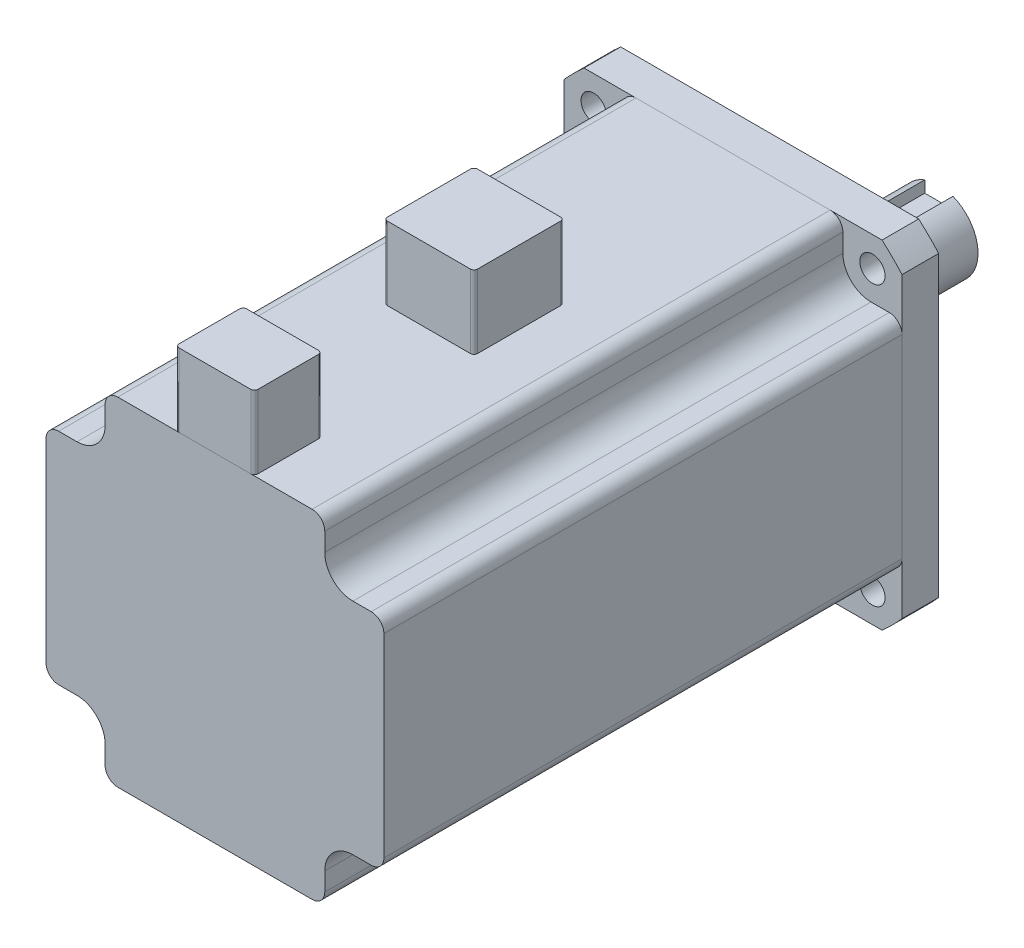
ISO-10303-21;
HEADER;
FILE_DESCRIPTION(('STEP AP214'),'2;1');
FILE_NAME('part.step','',(''),(''),'','','');
FILE_SCHEMA(('AUTOMOTIVE_DESIGN { 1 0 10303 214 1 1 1 1 }'));
ENDSEC;
DATA;
#1=APPLICATION_CONTEXT('core data for automotive mechanical design processes');
#2=APPLICATION_PROTOCOL_DEFINITION('international standard','automotive_design',2000,#1);
#3=PRODUCT_CONTEXT('',#1,'mechanical');
#4=PRODUCT('Part','Part','',(#3));
#5=PRODUCT_RELATED_PRODUCT_CATEGORY('part','',(#4));
#6=PRODUCT_DEFINITION_FORMATION('','',#4);
#7=PRODUCT_DEFINITION_CONTEXT('part definition',#1,'design');
#8=PRODUCT_DEFINITION('design','',#6,#7);
#9=PRODUCT_DEFINITION_SHAPE('','',#8);
#10=(LENGTH_UNIT() NAMED_UNIT(*) SI_UNIT(.MILLI.,.METRE.));
#11=(NAMED_UNIT(*) PLANE_ANGLE_UNIT() SI_UNIT($,.RADIAN.));
#12=(NAMED_UNIT(*) SI_UNIT($,.STERADIAN.) SOLID_ANGLE_UNIT());
#13=UNCERTAINTY_MEASURE_WITH_UNIT(LENGTH_MEASURE(1.E-05),#10,'distance_accuracy_value','');
#14=(GEOMETRIC_REPRESENTATION_CONTEXT(3) GLOBAL_UNCERTAINTY_ASSIGNED_CONTEXT((#13)) GLOBAL_UNIT_ASSIGNED_CONTEXT((#10,
#11,#12)) REPRESENTATION_CONTEXT('',''));
#15=CARTESIAN_POINT('',(0.,0.,0.));
#16=DIRECTION('',(0.,0.,1.));
#17=DIRECTION('',(1.,0.,0.));
#18=AXIS2_PLACEMENT_3D('',#15,#16,#17);
#19=CARTESIAN_POINT('',(-92.8833791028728,15.8148686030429,59.8614832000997));
#20=DIRECTION('',(0.,-1.,0.));
#21=DIRECTION('',(0.,0.,-1.));
#22=AXIS2_PLACEMENT_3D('',#19,#20,#21);
#23=CYLINDRICAL_SURFACE('',#22,0.638516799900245);
#24=CARTESIAN_POINT('',(-92.8833791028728,2.81486860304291,59.8614832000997));
#25=DIRECTION('',(0.,1.,0.));
#26=DIRECTION('',(0.,0.,-1.));
#27=AXIS2_PLACEMENT_3D('',#24,#25,#26);
#28=CIRCLE('',#27,0.638516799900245);
#29=CARTESIAN_POINT('',(-93.5218959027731,2.81486860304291,59.8614832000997));
#30=VERTEX_POINT('',#29);
#31=CARTESIAN_POINT('',(-92.8833791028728,2.81486860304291,60.5));
#32=VERTEX_POINT('',#31);
#33=EDGE_CURVE('E143',#30,#32,#28,.T.);
#34=ORIENTED_EDGE('',*,*,#33,.T.);
#35=DIRECTION('',(0.,-1.,0.));
#36=VECTOR('',#35,1.);
#37=CARTESIAN_POINT('',(-92.8833791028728,15.8148686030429,60.5));
#38=LINE('',#37,#36);
#39=CARTESIAN_POINT('',(-92.8833791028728,15.8148686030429,60.5));
#40=VERTEX_POINT('',#39);
#41=EDGE_CURVE('E12',#40,#32,#38,.T.);
#42=ORIENTED_EDGE('',*,*,#41,.F.);
#43=CARTESIAN_POINT('',(-92.8833791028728,15.8148686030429,59.8614832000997));
#44=DIRECTION('',(0.,1.,0.));
#45=DIRECTION('',(0.,0.,-1.));
#46=AXIS2_PLACEMENT_3D('',#43,#44,#45);
#47=CIRCLE('',#46,0.638516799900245);
#48=CARTESIAN_POINT('',(-93.5218959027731,15.8148686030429,59.8614832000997));
#49=VERTEX_POINT('',#48);
#50=EDGE_CURVE('E157',#49,#40,#47,.T.);
#51=ORIENTED_EDGE('',*,*,#50,.F.);
#52=DIRECTION('',(0.,-1.,0.));
#53=VECTOR('',#52,1.);
#54=CARTESIAN_POINT('',(-93.5218959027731,15.8148686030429,59.8614832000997));
#55=LINE('',#54,#53);
#56=EDGE_CURVE('E139',#49,#30,#55,.T.);
#57=ORIENTED_EDGE('',*,*,#56,.T.);
#58=EDGE_LOOP('',(#34,#42,#51,#57));
#59=FACE_BOUND('',#58,.T.);
#60=ADVANCED_FACE('F47',(#59),#23,.T.);
#61=CARTESIAN_POINT('',(-78.1604127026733,15.8148686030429,60.5));
#62=DIRECTION('',(0.,0.,-1.));
#63=DIRECTION('',(-1.,0.,0.));
#64=AXIS2_PLACEMENT_3D('',#61,#62,#63);
#65=PLANE('',#64);
#66=DIRECTION('',(1.,0.,0.));
#67=VECTOR('',#66,1.);
#68=CARTESIAN_POINT('',(-78.1604127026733,2.81486860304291,60.5));
#69=LINE('',#68,#67);
#70=CARTESIAN_POINT('',(-78.1604127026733,2.81486860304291,60.5));
#71=VERTEX_POINT('',#70);
#72=EDGE_CURVE('E146',#32,#71,#69,.T.);
#73=ORIENTED_EDGE('',*,*,#72,.T.);
#74=DIRECTION('',(0.,-1.,0.));
#75=VECTOR('',#74,1.);
#76=CARTESIAN_POINT('',(-78.1604127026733,15.8148686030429,60.5));
#77=LINE('',#76,#75);
#78=CARTESIAN_POINT('',(-78.1604127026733,15.8148686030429,60.5));
#79=VERTEX_POINT('',#78);
#80=EDGE_CURVE('E55',#79,#71,#77,.T.);
#81=ORIENTED_EDGE('',*,*,#80,.F.);
#82=DIRECTION('',(1.,0.,0.));
#83=VECTOR('',#82,1.);
#84=CARTESIAN_POINT('',(-78.1604127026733,15.8148686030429,60.5));
#85=LINE('',#84,#83);
#86=EDGE_CURVE('E106',#40,#79,#85,.T.);
#87=ORIENTED_EDGE('',*,*,#86,.F.);
#88=ORIENTED_EDGE('',*,*,#41,.T.);
#89=EDGE_LOOP('',(#73,#81,#87,#88));
#90=FACE_BOUND('',#89,.T.);
#91=ADVANCED_FACE('F192',(#90),#65,.F.);
#92=CARTESIAN_POINT('',(-78.1604127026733,15.8148686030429,59.8614832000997));
#93=DIRECTION('',(0.,-1.,0.));
#94=DIRECTION('',(0.,0.,-1.));
#95=AXIS2_PLACEMENT_3D('',#92,#93,#94);
#96=CYLINDRICAL_SURFACE('',#95,0.638516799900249);
#97=CARTESIAN_POINT('',(-78.1604127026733,2.81486860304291,59.8614832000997));
#98=DIRECTION('',(0.,1.,0.));
#99=DIRECTION('',(0.,0.,-1.));
#100=AXIS2_PLACEMENT_3D('',#97,#98,#99);
#101=CIRCLE('',#100,0.638516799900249);
#102=CARTESIAN_POINT('',(-77.5218959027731,2.81486860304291,59.8614832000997));
#103=VERTEX_POINT('',#102);
#104=EDGE_CURVE('E148',#71,#103,#101,.T.);
#105=ORIENTED_EDGE('',*,*,#104,.T.);
#106=DIRECTION('',(0.,-1.,0.));
#107=VECTOR('',#106,1.);
#108=CARTESIAN_POINT('',(-77.5218959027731,15.8148686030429,59.8614832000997));
#109=LINE('',#108,#107);
#110=CARTESIAN_POINT('',(-77.5218959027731,15.8148686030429,59.8614832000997));
#111=VERTEX_POINT('',#110);
#112=EDGE_CURVE('E164',#111,#103,#109,.T.);
#113=ORIENTED_EDGE('',*,*,#112,.F.);
#114=CARTESIAN_POINT('',(-78.1604127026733,15.8148686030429,59.8614832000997));
#115=DIRECTION('',(0.,1.,0.));
#116=DIRECTION('',(0.,0.,-1.));
#117=AXIS2_PLACEMENT_3D('',#114,#115,#116);
#118=CIRCLE('',#117,0.638516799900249);
#119=EDGE_CURVE('E172',#79,#111,#118,.T.);
#120=ORIENTED_EDGE('',*,*,#119,.F.);
#121=ORIENTED_EDGE('',*,*,#80,.T.);
#122=EDGE_LOOP('',(#105,#113,#120,#121));
#123=FACE_BOUND('',#122,.T.);
#124=ADVANCED_FACE('F170',(#123),#96,.T.);
#125=CARTESIAN_POINT('',(-77.5218959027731,15.8148686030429,45.1385167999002));
#126=DIRECTION('',(-1.,0.,0.));
#127=DIRECTION('',(0.,0.,1.));
#128=AXIS2_PLACEMENT_3D('',#125,#126,#127);
#129=PLANE('',#128);
#130=DIRECTION('',(0.,0.,-1.));
#131=VECTOR('',#130,1.);
#132=CARTESIAN_POINT('',(-77.5218959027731,2.81486860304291,45.1385167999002));
#133=LINE('',#132,#131);
#134=CARTESIAN_POINT('',(-77.5218959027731,2.81486860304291,45.1385167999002));
#135=VERTEX_POINT('',#134);
#136=EDGE_CURVE('E150',#103,#135,#133,.T.);
#137=ORIENTED_EDGE('',*,*,#136,.T.);
#138=DIRECTION('',(0.,-1.,0.));
#139=VECTOR('',#138,1.);
#140=CARTESIAN_POINT('',(-77.5218959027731,15.8148686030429,45.1385167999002));
#141=LINE('',#140,#139);
#142=CARTESIAN_POINT('',(-77.5218959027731,15.8148686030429,45.1385167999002));
#143=VERTEX_POINT('',#142);
#144=EDGE_CURVE('E161',#143,#135,#141,.T.);
#145=ORIENTED_EDGE('',*,*,#144,.F.);
#146=DIRECTION('',(0.,0.,-1.));
#147=VECTOR('',#146,1.);
#148=CARTESIAN_POINT('',(-77.5218959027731,15.8148686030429,45.1385167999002));
#149=LINE('',#148,#147);
#150=EDGE_CURVE('E184',#111,#143,#149,.T.);
#151=ORIENTED_EDGE('',*,*,#150,.F.);
#152=ORIENTED_EDGE('',*,*,#112,.T.);
#153=EDGE_LOOP('',(#137,#145,#151,#152));
#154=FACE_BOUND('',#153,.T.);
#155=ADVANCED_FACE('F180',(#154),#129,.F.);
#156=CARTESIAN_POINT('',(-78.1604127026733,15.8148686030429,45.1385167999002));
#157=DIRECTION('',(0.,-1.,0.));
#158=DIRECTION('',(0.,0.,-1.));
#159=AXIS2_PLACEMENT_3D('',#156,#157,#158);
#160=CYLINDRICAL_SURFACE('',#159,0.638516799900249);
#161=CARTESIAN_POINT('',(-78.1604127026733,2.81486860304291,45.1385167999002));
#162=DIRECTION('',(0.,1.,0.));
#163=DIRECTION('',(0.,0.,-1.));
#164=AXIS2_PLACEMENT_3D('',#161,#162,#163);
#165=CIRCLE('',#164,0.638516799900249);
#166=CARTESIAN_POINT('',(-78.1604127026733,2.81486860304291,44.5));
#167=VERTEX_POINT('',#166);
#168=EDGE_CURVE('E152',#135,#167,#165,.T.);
#169=ORIENTED_EDGE('',*,*,#168,.T.);
#170=DIRECTION('',(0.,-1.,0.));
#171=VECTOR('',#170,1.);
#172=CARTESIAN_POINT('',(-78.1604127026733,15.8148686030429,44.5));
#173=LINE('',#172,#171);
#174=CARTESIAN_POINT('',(-78.1604127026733,15.8148686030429,44.5));
#175=VERTEX_POINT('',#174);
#176=EDGE_CURVE('E134',#175,#167,#173,.T.);
#177=ORIENTED_EDGE('',*,*,#176,.F.);
#178=CARTESIAN_POINT('',(-78.1604127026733,15.8148686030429,45.1385167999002));
#179=DIRECTION('',(0.,1.,0.));
#180=DIRECTION('',(0.,0.,-1.));
#181=AXIS2_PLACEMENT_3D('',#178,#179,#180);
#182=CIRCLE('',#181,0.638516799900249);
#183=EDGE_CURVE('E125',#143,#175,#182,.T.);
#184=ORIENTED_EDGE('',*,*,#183,.F.);
#185=ORIENTED_EDGE('',*,*,#144,.T.);
#186=EDGE_LOOP('',(#169,#177,#184,#185));
#187=FACE_BOUND('',#186,.T.);
#188=ADVANCED_FACE('F183',(#187),#160,.T.);
#189=CARTESIAN_POINT('',(-78.1604127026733,15.8148686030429,44.5));
#190=DIRECTION('',(0.,0.,1.));
#191=DIRECTION('',(1.,0.,0.));
#192=AXIS2_PLACEMENT_3D('',#189,#190,#191);
#193=PLANE('',#192);
#194=DIRECTION('',(-1.,0.,0.));
#195=VECTOR('',#194,1.);
#196=CARTESIAN_POINT('',(-78.1604127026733,2.81486860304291,44.5));
#197=LINE('',#196,#195);
#198=CARTESIAN_POINT('',(-92.8833791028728,2.81486860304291,44.5));
#199=VERTEX_POINT('',#198);
#200=EDGE_CURVE('E133',#167,#199,#197,.T.);
#201=ORIENTED_EDGE('',*,*,#200,.T.);
#202=DIRECTION('',(0.,-1.,0.));
#203=VECTOR('',#202,1.);
#204=CARTESIAN_POINT('',(-92.8833791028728,15.8148686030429,44.5));
#205=LINE('',#204,#203);
#206=CARTESIAN_POINT('',(-92.8833791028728,15.8148686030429,44.5));
#207=VERTEX_POINT('',#206);
#208=EDGE_CURVE('E130',#207,#199,#205,.T.);
#209=ORIENTED_EDGE('',*,*,#208,.F.);
#210=DIRECTION('',(-1.,0.,0.));
#211=VECTOR('',#210,1.);
#212=CARTESIAN_POINT('',(-78.1604127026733,15.8148686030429,44.5));
#213=LINE('',#212,#211);
#214=EDGE_CURVE('E119',#175,#207,#213,.T.);
#215=ORIENTED_EDGE('',*,*,#214,.F.);
#216=ORIENTED_EDGE('',*,*,#176,.T.);
#217=EDGE_LOOP('',(#201,#209,#215,#216));
#218=FACE_BOUND('',#217,.T.);
#219=ADVANCED_FACE('F131',(#218),#193,.F.);
#220=CARTESIAN_POINT('',(-92.8833791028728,15.8148686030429,45.1385167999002));
#221=DIRECTION('',(0.,-1.,0.));
#222=DIRECTION('',(0.,0.,-1.));
#223=AXIS2_PLACEMENT_3D('',#220,#221,#222);
#224=CYLINDRICAL_SURFACE('',#223,0.638516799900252);
#225=CARTESIAN_POINT('',(-92.8833791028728,2.81486860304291,45.1385167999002));
#226=DIRECTION('',(0.,1.,0.));
#227=DIRECTION('',(0.,0.,1.));
#228=AXIS2_PLACEMENT_3D('',#225,#226,#227);
#229=CIRCLE('',#228,0.638516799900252);
#230=CARTESIAN_POINT('',(-93.5218959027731,2.81486860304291,45.1385167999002));
#231=VERTEX_POINT('',#230);
#232=EDGE_CURVE('E92',#199,#231,#229,.T.);
#233=ORIENTED_EDGE('',*,*,#232,.T.);
#234=DIRECTION('',(0.,-1.,0.));
#235=VECTOR('',#234,1.);
#236=CARTESIAN_POINT('',(-93.5218959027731,15.8148686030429,45.1385167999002));
#237=LINE('',#236,#235);
#238=CARTESIAN_POINT('',(-93.5218959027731,15.8148686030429,45.1385167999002));
#239=VERTEX_POINT('',#238);
#240=EDGE_CURVE('E135',#239,#231,#237,.T.);
#241=ORIENTED_EDGE('',*,*,#240,.F.);
#242=CARTESIAN_POINT('',(-92.8833791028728,15.8148686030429,45.1385167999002));
#243=DIRECTION('',(0.,1.,0.));
#244=DIRECTION('',(0.,0.,1.));
#245=AXIS2_PLACEMENT_3D('',#242,#243,#244);
#246=CIRCLE('',#245,0.638516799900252);
#247=EDGE_CURVE('E123',#207,#239,#246,.T.);
#248=ORIENTED_EDGE('',*,*,#247,.F.);
#249=ORIENTED_EDGE('',*,*,#208,.T.);
#250=EDGE_LOOP('',(#233,#241,#248,#249));
#251=FACE_BOUND('',#250,.T.);
#252=ADVANCED_FACE('F137',(#251),#224,.T.);
#253=CARTESIAN_POINT('',(-93.5218959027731,15.8148686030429,45.1385167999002));
#254=DIRECTION('',(1.,0.,0.));
#255=DIRECTION('',(0.,0.,-1.));
#256=AXIS2_PLACEMENT_3D('',#253,#254,#255);
#257=PLANE('',#256);
#258=DIRECTION('',(0.,0.,1.));
#259=VECTOR('',#258,1.);
#260=CARTESIAN_POINT('',(-93.5218959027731,2.81486860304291,45.1385167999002));
#261=LINE('',#260,#259);
#262=EDGE_CURVE('E98',#231,#30,#261,.T.);
#263=ORIENTED_EDGE('',*,*,#262,.T.);
#264=ORIENTED_EDGE('',*,*,#56,.F.);
#265=DIRECTION('',(0.,0.,1.));
#266=VECTOR('',#265,1.);
#267=CARTESIAN_POINT('',(-93.5218959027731,15.8148686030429,45.1385167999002));
#268=LINE('',#267,#266);
#269=EDGE_CURVE('E63',#239,#49,#268,.T.);
#270=ORIENTED_EDGE('',*,*,#269,.F.);
#271=ORIENTED_EDGE('',*,*,#240,.T.);
#272=EDGE_LOOP('',(#263,#264,#270,#271));
#273=FACE_BOUND('',#272,.T.);
#274=ADVANCED_FACE('F208',(#273),#257,.F.);
#275=CARTESIAN_POINT('',(-92.8833791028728,15.8148686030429,59.8614832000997));
#276=DIRECTION('',(0.,-1.,0.));
#277=DIRECTION('',(0.,0.,-1.));
#278=AXIS2_PLACEMENT_3D('',#275,#276,#277);
#279=PLANE('',#278);
#280=ORIENTED_EDGE('',*,*,#50,.T.);
#281=ORIENTED_EDGE('',*,*,#86,.T.);
#282=ORIENTED_EDGE('',*,*,#119,.T.);
#283=ORIENTED_EDGE('',*,*,#150,.T.);
#284=ORIENTED_EDGE('',*,*,#183,.T.);
#285=ORIENTED_EDGE('',*,*,#214,.T.);
#286=ORIENTED_EDGE('',*,*,#247,.T.);
#287=ORIENTED_EDGE('',*,*,#269,.T.);
#288=EDGE_LOOP('',(#280,#281,#282,#283,#284,#285,#286,#287));
#289=FACE_BOUND('',#288,.T.);
#290=ADVANCED_FACE('F121',(#289),#279,.F.);
#291=CARTESIAN_POINT('',(-92.8833791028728,2.81486860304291,59.8614832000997));
#292=DIRECTION('',(0.,-1.,0.));
#293=DIRECTION('',(0.,0.,-1.));
#294=AXIS2_PLACEMENT_3D('',#291,#292,#293);
#295=PLANE('',#294);
#296=ORIENTED_EDGE('',*,*,#33,.F.);
#297=ORIENTED_EDGE('',*,*,#262,.F.);
#298=ORIENTED_EDGE('',*,*,#232,.F.);
#299=ORIENTED_EDGE('',*,*,#200,.F.);
#300=ORIENTED_EDGE('',*,*,#168,.F.);
#301=ORIENTED_EDGE('',*,*,#136,.F.);
#302=ORIENTED_EDGE('',*,*,#104,.F.);
#303=ORIENTED_EDGE('',*,*,#72,.F.);
#304=EDGE_LOOP('',(#296,#297,#298,#299,#300,#301,#302,#303));
#305=FACE_BOUND('',#304,.T.);
#306=ADVANCED_FACE('F176',(#305),#295,.T.);
#307=CLOSED_SHELL('',(#60,#91,#124,#155,#188,#219,#252,#274,#290,#306));
#308=MANIFOLD_SOLID_BREP('B2',#307);
#309=CARTESIAN_POINT('',(-91.8833791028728,15.8148686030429,97.8614832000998));
#310=DIRECTION('',(0.,-1.,0.));
#311=DIRECTION('',(0.,0.,-1.));
#312=AXIS2_PLACEMENT_3D('',#309,#310,#311);
#313=CYLINDRICAL_SURFACE('',#312,0.638516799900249);
#314=CARTESIAN_POINT('',(-91.8833791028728,2.81486860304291,97.8614832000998));
#315=DIRECTION('',(0.,1.,0.));
#316=DIRECTION('',(0.,0.,-1.));
#317=AXIS2_PLACEMENT_3D('',#314,#315,#316);
#318=CIRCLE('',#317,0.638516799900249);
#319=CARTESIAN_POINT('',(-92.5218959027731,2.81486860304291,97.8614832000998));
#320=VERTEX_POINT('',#319);
#321=CARTESIAN_POINT('',(-91.8833791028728,2.81486860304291,98.5));
#322=VERTEX_POINT('',#321);
#323=EDGE_CURVE('E380',#320,#322,#318,.T.);
#324=ORIENTED_EDGE('',*,*,#323,.T.);
#325=DIRECTION('',(0.,-1.,0.));
#326=VECTOR('',#325,1.);
#327=CARTESIAN_POINT('',(-91.8833791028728,15.8148686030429,98.5));
#328=LINE('',#327,#326);
#329=CARTESIAN_POINT('',(-91.8833791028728,15.8148686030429,98.5));
#330=VERTEX_POINT('',#329);
#331=EDGE_CURVE('E45',#330,#322,#328,.T.);
#332=ORIENTED_EDGE('',*,*,#331,.F.);
#333=CARTESIAN_POINT('',(-91.8833791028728,15.8148686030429,97.8614832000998));
#334=DIRECTION('',(0.,1.,0.));
#335=DIRECTION('',(0.,0.,-1.));
#336=AXIS2_PLACEMENT_3D('',#333,#334,#335);
#337=CIRCLE('',#336,0.638516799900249);
#338=CARTESIAN_POINT('',(-92.5218959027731,15.8148686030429,97.8614832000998));
#339=VERTEX_POINT('',#338);
#340=EDGE_CURVE('E394',#339,#330,#337,.T.);
#341=ORIENTED_EDGE('',*,*,#340,.F.);
#342=DIRECTION('',(0.,-1.,0.));
#343=VECTOR('',#342,1.);
#344=CARTESIAN_POINT('',(-92.5218959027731,15.8148686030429,97.8614832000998));
#345=LINE('',#344,#343);
#346=EDGE_CURVE('E376',#339,#320,#345,.T.);
#347=ORIENTED_EDGE('',*,*,#346,.T.);
#348=EDGE_LOOP('',(#324,#332,#341,#347));
#349=FACE_BOUND('',#348,.T.);
#350=ADVANCED_FACE('F284',(#349),#313,.T.);
#351=CARTESIAN_POINT('',(-79.1604127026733,15.8148686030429,98.5));
#352=DIRECTION('',(0.,0.,-1.));
#353=DIRECTION('',(-1.,0.,0.));
#354=AXIS2_PLACEMENT_3D('',#351,#352,#353);
#355=PLANE('',#354);
#356=DIRECTION('',(1.,0.,0.));
#357=VECTOR('',#356,1.);
#358=CARTESIAN_POINT('',(-79.1604127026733,2.81486860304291,98.5));
#359=LINE('',#358,#357);
#360=CARTESIAN_POINT('',(-79.1604127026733,2.81486860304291,98.5));
#361=VERTEX_POINT('',#360);
#362=EDGE_CURVE('E383',#322,#361,#359,.T.);
#363=ORIENTED_EDGE('',*,*,#362,.T.);
#364=DIRECTION('',(0.,-1.,0.));
#365=VECTOR('',#364,1.);
#366=CARTESIAN_POINT('',(-79.1604127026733,15.8148686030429,98.5));
#367=LINE('',#366,#365);
#368=CARTESIAN_POINT('',(-79.1604127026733,15.8148686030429,98.5));
#369=VERTEX_POINT('',#368);
#370=EDGE_CURVE('E292',#369,#361,#367,.T.);
#371=ORIENTED_EDGE('',*,*,#370,.F.);
#372=DIRECTION('',(1.,0.,0.));
#373=VECTOR('',#372,1.);
#374=CARTESIAN_POINT('',(-79.1604127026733,15.8148686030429,98.5));
#375=LINE('',#374,#373);
#376=EDGE_CURVE('E343',#330,#369,#375,.T.);
#377=ORIENTED_EDGE('',*,*,#376,.F.);
#378=ORIENTED_EDGE('',*,*,#331,.T.);
#379=EDGE_LOOP('',(#363,#371,#377,#378));
#380=FACE_BOUND('',#379,.T.);
#381=ADVANCED_FACE('F429',(#380),#355,.F.);
#382=CARTESIAN_POINT('',(-79.1604127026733,15.8148686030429,97.8614832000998));
#383=DIRECTION('',(0.,-1.,0.));
#384=DIRECTION('',(0.,0.,-1.));
#385=AXIS2_PLACEMENT_3D('',#382,#383,#384);
#386=CYLINDRICAL_SURFACE('',#385,0.638516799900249);
#387=CARTESIAN_POINT('',(-79.1604127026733,2.81486860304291,97.8614832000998));
#388=DIRECTION('',(0.,1.,0.));
#389=DIRECTION('',(0.,0.,-1.));
#390=AXIS2_PLACEMENT_3D('',#387,#388,#389);
#391=CIRCLE('',#390,0.638516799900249);
#392=CARTESIAN_POINT('',(-78.5218959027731,2.81486860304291,97.8614832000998));
#393=VERTEX_POINT('',#392);
#394=EDGE_CURVE('E385',#361,#393,#391,.T.);
#395=ORIENTED_EDGE('',*,*,#394,.T.);
#396=DIRECTION('',(0.,-1.,0.));
#397=VECTOR('',#396,1.);
#398=CARTESIAN_POINT('',(-78.5218959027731,15.8148686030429,97.8614832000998));
#399=LINE('',#398,#397);
#400=CARTESIAN_POINT('',(-78.5218959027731,15.8148686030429,97.8614832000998));
#401=VERTEX_POINT('',#400);
#402=EDGE_CURVE('E401',#401,#393,#399,.T.);
#403=ORIENTED_EDGE('',*,*,#402,.F.);
#404=CARTESIAN_POINT('',(-79.1604127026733,15.8148686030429,97.8614832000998));
#405=DIRECTION('',(0.,1.,0.));
#406=DIRECTION('',(0.,0.,-1.));
#407=AXIS2_PLACEMENT_3D('',#404,#405,#406);
#408=CIRCLE('',#407,0.638516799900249);
#409=EDGE_CURVE('E409',#369,#401,#408,.T.);
#410=ORIENTED_EDGE('',*,*,#409,.F.);
#411=ORIENTED_EDGE('',*,*,#370,.T.);
#412=EDGE_LOOP('',(#395,#403,#410,#411));
#413=FACE_BOUND('',#412,.T.);
#414=ADVANCED_FACE('F407',(#413),#386,.T.);
#415=CARTESIAN_POINT('',(-78.5218959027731,15.8148686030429,87.1385167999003));
#416=DIRECTION('',(-1.,0.,0.));
#417=DIRECTION('',(0.,0.,1.));
#418=AXIS2_PLACEMENT_3D('',#415,#416,#417);
#419=PLANE('',#418);
#420=DIRECTION('',(0.,0.,-1.));
#421=VECTOR('',#420,1.);
#422=CARTESIAN_POINT('',(-78.5218959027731,2.81486860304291,87.1385167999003));
#423=LINE('',#422,#421);
#424=CARTESIAN_POINT('',(-78.5218959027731,2.81486860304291,87.1385167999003));
#425=VERTEX_POINT('',#424);
#426=EDGE_CURVE('E387',#393,#425,#423,.T.);
#427=ORIENTED_EDGE('',*,*,#426,.T.);
#428=DIRECTION('',(0.,-1.,0.));
#429=VECTOR('',#428,1.);
#430=CARTESIAN_POINT('',(-78.5218959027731,15.8148686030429,87.1385167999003));
#431=LINE('',#430,#429);
#432=CARTESIAN_POINT('',(-78.5218959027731,15.8148686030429,87.1385167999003));
#433=VERTEX_POINT('',#432);
#434=EDGE_CURVE('E398',#433,#425,#431,.T.);
#435=ORIENTED_EDGE('',*,*,#434,.F.);
#436=DIRECTION('',(0.,0.,-1.));
#437=VECTOR('',#436,1.);
#438=CARTESIAN_POINT('',(-78.5218959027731,15.8148686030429,87.1385167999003));
#439=LINE('',#438,#437);
#440=EDGE_CURVE('E421',#401,#433,#439,.T.);
#441=ORIENTED_EDGE('',*,*,#440,.F.);
#442=ORIENTED_EDGE('',*,*,#402,.T.);
#443=EDGE_LOOP('',(#427,#435,#441,#442));
#444=FACE_BOUND('',#443,.T.);
#445=ADVANCED_FACE('F417',(#444),#419,.F.);
#446=CARTESIAN_POINT('',(-79.1604127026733,15.8148686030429,87.1385167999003));
#447=DIRECTION('',(0.,-1.,0.));
#448=DIRECTION('',(0.,0.,-1.));
#449=AXIS2_PLACEMENT_3D('',#446,#447,#448);
#450=CYLINDRICAL_SURFACE('',#449,0.638516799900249);
#451=CARTESIAN_POINT('',(-79.1604127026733,2.81486860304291,87.1385167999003));
#452=DIRECTION('',(0.,1.,0.));
#453=DIRECTION('',(0.,0.,-1.));
#454=AXIS2_PLACEMENT_3D('',#451,#452,#453);
#455=CIRCLE('',#454,0.638516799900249);
#456=CARTESIAN_POINT('',(-79.1604127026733,2.81486860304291,86.5));
#457=VERTEX_POINT('',#456);
#458=EDGE_CURVE('E389',#425,#457,#455,.T.);
#459=ORIENTED_EDGE('',*,*,#458,.T.);
#460=DIRECTION('',(0.,-1.,0.));
#461=VECTOR('',#460,1.);
#462=CARTESIAN_POINT('',(-79.1604127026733,15.8148686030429,86.5));
#463=LINE('',#462,#461);
#464=CARTESIAN_POINT('',(-79.1604127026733,15.8148686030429,86.5));
#465=VERTEX_POINT('',#464);
#466=EDGE_CURVE('E371',#465,#457,#463,.T.);
#467=ORIENTED_EDGE('',*,*,#466,.F.);
#468=CARTESIAN_POINT('',(-79.1604127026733,15.8148686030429,87.1385167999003));
#469=DIRECTION('',(0.,1.,0.));
#470=DIRECTION('',(0.,0.,-1.));
#471=AXIS2_PLACEMENT_3D('',#468,#469,#470);
#472=CIRCLE('',#471,0.638516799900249);
#473=EDGE_CURVE('E362',#433,#465,#472,.T.);
#474=ORIENTED_EDGE('',*,*,#473,.F.);
#475=ORIENTED_EDGE('',*,*,#434,.T.);
#476=EDGE_LOOP('',(#459,#467,#474,#475));
#477=FACE_BOUND('',#476,.T.);
#478=ADVANCED_FACE('F420',(#477),#450,.T.);
#479=CARTESIAN_POINT('',(-79.1604127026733,15.8148686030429,86.5));
#480=DIRECTION('',(0.,0.,1.));
#481=DIRECTION('',(1.,0.,0.));
#482=AXIS2_PLACEMENT_3D('',#479,#480,#481);
#483=PLANE('',#482);
#484=DIRECTION('',(-1.,0.,0.));
#485=VECTOR('',#484,1.);
#486=CARTESIAN_POINT('',(-79.1604127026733,2.81486860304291,86.5));
#487=LINE('',#486,#485);
#488=CARTESIAN_POINT('',(-91.8833791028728,2.81486860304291,86.5));
#489=VERTEX_POINT('',#488);
#490=EDGE_CURVE('E370',#457,#489,#487,.T.);
#491=ORIENTED_EDGE('',*,*,#490,.T.);
#492=DIRECTION('',(0.,-1.,0.));
#493=VECTOR('',#492,1.);
#494=CARTESIAN_POINT('',(-91.8833791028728,15.8148686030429,86.5));
#495=LINE('',#494,#493);
#496=CARTESIAN_POINT('',(-91.8833791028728,15.8148686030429,86.5));
#497=VERTEX_POINT('',#496);
#498=EDGE_CURVE('E367',#497,#489,#495,.T.);
#499=ORIENTED_EDGE('',*,*,#498,.F.);
#500=DIRECTION('',(-1.,0.,0.));
#501=VECTOR('',#500,1.);
#502=CARTESIAN_POINT('',(-79.1604127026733,15.8148686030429,86.5));
#503=LINE('',#502,#501);
#504=EDGE_CURVE('E356',#465,#497,#503,.T.);
#505=ORIENTED_EDGE('',*,*,#504,.F.);
#506=ORIENTED_EDGE('',*,*,#466,.T.);
#507=EDGE_LOOP('',(#491,#499,#505,#506));
#508=FACE_BOUND('',#507,.T.);
#509=ADVANCED_FACE('F368',(#508),#483,.F.);
#510=CARTESIAN_POINT('',(-91.8833791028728,15.8148686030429,87.1385167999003));
#511=DIRECTION('',(0.,-1.,0.));
#512=DIRECTION('',(0.,0.,-1.));
#513=AXIS2_PLACEMENT_3D('',#510,#511,#512);
#514=CYLINDRICAL_SURFACE('',#513,0.638516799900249);
#515=CARTESIAN_POINT('',(-91.8833791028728,2.81486860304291,87.1385167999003));
#516=DIRECTION('',(0.,1.,0.));
#517=DIRECTION('',(0.,0.,1.));
#518=AXIS2_PLACEMENT_3D('',#515,#516,#517);
#519=CIRCLE('',#518,0.638516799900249);
#520=CARTESIAN_POINT('',(-92.5218959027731,2.81486860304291,87.1385167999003));
#521=VERTEX_POINT('',#520);
#522=EDGE_CURVE('E329',#489,#521,#519,.T.);
#523=ORIENTED_EDGE('',*,*,#522,.T.);
#524=DIRECTION('',(0.,-1.,0.));
#525=VECTOR('',#524,1.);
#526=CARTESIAN_POINT('',(-92.5218959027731,15.8148686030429,87.1385167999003));
#527=LINE('',#526,#525);
#528=CARTESIAN_POINT('',(-92.5218959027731,15.8148686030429,87.1385167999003));
#529=VERTEX_POINT('',#528);
#530=EDGE_CURVE('E372',#529,#521,#527,.T.);
#531=ORIENTED_EDGE('',*,*,#530,.F.);
#532=CARTESIAN_POINT('',(-91.8833791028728,15.8148686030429,87.1385167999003));
#533=DIRECTION('',(0.,1.,0.));
#534=DIRECTION('',(0.,0.,1.));
#535=AXIS2_PLACEMENT_3D('',#532,#533,#534);
#536=CIRCLE('',#535,0.638516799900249);
#537=EDGE_CURVE('E360',#497,#529,#536,.T.);
#538=ORIENTED_EDGE('',*,*,#537,.F.);
#539=ORIENTED_EDGE('',*,*,#498,.T.);
#540=EDGE_LOOP('',(#523,#531,#538,#539));
#541=FACE_BOUND('',#540,.T.);
#542=ADVANCED_FACE('F374',(#541),#514,.T.);
#543=CARTESIAN_POINT('',(-92.5218959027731,15.8148686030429,87.1385167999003));
#544=DIRECTION('',(1.,0.,0.));
#545=DIRECTION('',(0.,0.,-1.));
#546=AXIS2_PLACEMENT_3D('',#543,#544,#545);
#547=PLANE('',#546);
#548=DIRECTION('',(0.,0.,1.));
#549=VECTOR('',#548,1.);
#550=CARTESIAN_POINT('',(-92.5218959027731,2.81486860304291,87.1385167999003));
#551=LINE('',#550,#549);
#552=EDGE_CURVE('E335',#521,#320,#551,.T.);
#553=ORIENTED_EDGE('',*,*,#552,.T.);
#554=ORIENTED_EDGE('',*,*,#346,.F.);
#555=DIRECTION('',(0.,0.,1.));
#556=VECTOR('',#555,1.);
#557=CARTESIAN_POINT('',(-92.5218959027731,15.8148686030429,87.1385167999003));
#558=LINE('',#557,#556);
#559=EDGE_CURVE('E300',#529,#339,#558,.T.);
#560=ORIENTED_EDGE('',*,*,#559,.F.);
#561=ORIENTED_EDGE('',*,*,#530,.T.);
#562=EDGE_LOOP('',(#553,#554,#560,#561));
#563=FACE_BOUND('',#562,.T.);
#564=ADVANCED_FACE('F445',(#563),#547,.F.);
#565=CARTESIAN_POINT('',(-91.8833791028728,15.8148686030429,97.8614832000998));
#566=DIRECTION('',(0.,-1.,0.));
#567=DIRECTION('',(0.,0.,-1.));
#568=AXIS2_PLACEMENT_3D('',#565,#566,#567);
#569=PLANE('',#568);
#570=ORIENTED_EDGE('',*,*,#340,.T.);
#571=ORIENTED_EDGE('',*,*,#376,.T.);
#572=ORIENTED_EDGE('',*,*,#409,.T.);
#573=ORIENTED_EDGE('',*,*,#440,.T.);
#574=ORIENTED_EDGE('',*,*,#473,.T.);
#575=ORIENTED_EDGE('',*,*,#504,.T.);
#576=ORIENTED_EDGE('',*,*,#537,.T.);
#577=ORIENTED_EDGE('',*,*,#559,.T.);
#578=EDGE_LOOP('',(#570,#571,#572,#573,#574,#575,#576,#577));
#579=FACE_BOUND('',#578,.T.);
#580=ADVANCED_FACE('F358',(#579),#569,.F.);
#581=CARTESIAN_POINT('',(-91.8833791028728,2.81486860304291,97.8614832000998));
#582=DIRECTION('',(0.,-1.,0.));
#583=DIRECTION('',(0.,0.,-1.));
#584=AXIS2_PLACEMENT_3D('',#581,#582,#583);
#585=PLANE('',#584);
#586=ORIENTED_EDGE('',*,*,#323,.F.);
#587=ORIENTED_EDGE('',*,*,#552,.F.);
#588=ORIENTED_EDGE('',*,*,#522,.F.);
#589=ORIENTED_EDGE('',*,*,#490,.F.);
#590=ORIENTED_EDGE('',*,*,#458,.F.);
#591=ORIENTED_EDGE('',*,*,#426,.F.);
#592=ORIENTED_EDGE('',*,*,#394,.F.);
#593=ORIENTED_EDGE('',*,*,#362,.F.);
#594=EDGE_LOOP('',(#586,#587,#588,#589,#590,#591,#592,#593));
#595=FACE_BOUND('',#594,.T.);
#596=ADVANCED_FACE('F413',(#595),#585,.T.);
#597=CLOSED_SHELL('',(#350,#381,#414,#445,#478,#509,#542,#564,#580,#596));
#598=MANIFOLD_SOLID_BREP('B6',#597);
#599=CARTESIAN_POINT('',(-61.0218959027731,-51.6851313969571,98.5));
#600=DIRECTION('',(0.,0.,-1.));
#601=DIRECTION('',(-1.,0.,0.));
#602=AXIS2_PLACEMENT_3D('',#599,#600,#601);
#603=CYLINDRICAL_SURFACE('',#602,5.);
#604=CARTESIAN_POINT('',(-61.0218959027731,-51.6851313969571,6.5));
#605=DIRECTION('',(0.,0.,-1.));
#606=DIRECTION('',(1.,0.,0.));
#607=AXIS2_PLACEMENT_3D('',#604,#605,#606);
#608=CIRCLE('',#607,5.);
#609=CARTESIAN_POINT('',(-66.0218959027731,-51.6851313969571,6.5));
#610=VERTEX_POINT('',#609);
#611=CARTESIAN_POINT('',(-61.021895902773,-46.6851313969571,6.5));
#612=VERTEX_POINT('',#611);
#613=EDGE_CURVE('E712',#610,#612,#608,.T.);
#614=ORIENTED_EDGE('',*,*,#613,.T.);
#615=DIRECTION('',(0.,0.,-1.));
#616=VECTOR('',#615,1.);
#617=CARTESIAN_POINT('',(-61.021895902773,-46.6851313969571,98.5));
#618=LINE('',#617,#616);
#619=CARTESIAN_POINT('',(-61.021895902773,-46.6851313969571,98.5));
#620=VERTEX_POINT('',#619);
#621=EDGE_CURVE('E282',#620,#612,#618,.T.);
#622=ORIENTED_EDGE('',*,*,#621,.F.);
#623=CARTESIAN_POINT('',(-61.0218959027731,-51.6851313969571,98.5));
#624=DIRECTION('',(0.,0.,-1.));
#625=DIRECTION('',(1.,0.,0.));
#626=AXIS2_PLACEMENT_3D('',#623,#624,#625);
#627=CIRCLE('',#626,5.);
#628=CARTESIAN_POINT('',(-66.0218959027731,-51.6851313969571,98.5));
#629=VERTEX_POINT('',#628);
#630=EDGE_CURVE('E758',#629,#620,#627,.T.);
#631=ORIENTED_EDGE('',*,*,#630,.F.);
#632=DIRECTION('',(0.,0.,-1.));
#633=VECTOR('',#632,1.);
#634=CARTESIAN_POINT('',(-66.0218959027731,-51.6851313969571,98.5));
#635=LINE('',#634,#633);
#636=EDGE_CURVE('E708',#629,#610,#635,.T.);
#637=ORIENTED_EDGE('',*,*,#636,.T.);
#638=EDGE_LOOP('',(#614,#622,#631,#637));
#639=FACE_BOUND('',#638,.T.);
#640=ADVANCED_FACE('F520',(#639),#603,.F.);
#641=CARTESIAN_POINT('',(-61.021895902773,-46.6851313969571,98.5));
#642=DIRECTION('',(0.,1.,0.));
#643=DIRECTION('',(0.,0.,1.));
#644=AXIS2_PLACEMENT_3D('',#641,#642,#643);
#645=PLANE('',#644);
#646=DIRECTION('',(1.,0.,0.));
#647=VECTOR('',#646,1.);
#648=CARTESIAN_POINT('',(-61.021895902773,-46.6851313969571,6.5));
#649=LINE('',#648,#647);
#650=CARTESIAN_POINT('',(-57.7761754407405,-46.6851313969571,6.5));
#651=VERTEX_POINT('',#650);
#652=EDGE_CURVE('E715',#612,#651,#649,.T.);
#653=ORIENTED_EDGE('',*,*,#652,.T.);
#654=DIRECTION('',(0.,0.,-1.));
#655=VECTOR('',#654,1.);
#656=CARTESIAN_POINT('',(-57.7761754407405,-46.6851313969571,98.5));
#657=LINE('',#656,#655);
#658=CARTESIAN_POINT('',(-57.7761754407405,-46.6851313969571,98.5));
#659=VERTEX_POINT('',#658);
#660=EDGE_CURVE('E528',#659,#651,#657,.T.);
#661=ORIENTED_EDGE('',*,*,#660,.F.);
#662=DIRECTION('',(1.,0.,0.));
#663=VECTOR('',#662,1.);
#664=CARTESIAN_POINT('',(-61.021895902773,-46.6851313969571,98.5));
#665=LINE('',#664,#663);
#666=EDGE_CURVE('E627',#620,#659,#665,.T.);
#667=ORIENTED_EDGE('',*,*,#666,.F.);
#668=ORIENTED_EDGE('',*,*,#621,.T.);
#669=EDGE_LOOP('',(#653,#661,#667,#668));
#670=FACE_BOUND('',#669,.T.);
#671=ADVANCED_FACE('F896',(#670),#645,.F.);
#672=CARTESIAN_POINT('',(-57.7761754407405,-44.4308518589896,98.5));
#673=DIRECTION('',(0.,0.,-1.));
#674=DIRECTION('',(-1.,0.,0.));
#675=AXIS2_PLACEMENT_3D('',#672,#673,#674);
#676=CYLINDRICAL_SURFACE('',#675,2.25427953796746);
#677=CARTESIAN_POINT('',(-57.7761754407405,-44.4308518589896,6.5));
#678=DIRECTION('',(0.,0.,1.));
#679=DIRECTION('',(-1.,0.,0.));
#680=AXIS2_PLACEMENT_3D('',#677,#678,#679);
#681=CIRCLE('',#680,2.25427953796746);
#682=CARTESIAN_POINT('',(-55.5218959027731,-44.4308518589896,6.5));
#683=VERTEX_POINT('',#682);
#684=EDGE_CURVE('E717',#651,#683,#681,.T.);
#685=ORIENTED_EDGE('',*,*,#684,.T.);
#686=DIRECTION('',(0.,0.,-1.));
#687=VECTOR('',#686,1.);
#688=CARTESIAN_POINT('',(-55.5218959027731,-44.4308518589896,98.5));
#689=LINE('',#688,#687);
#690=CARTESIAN_POINT('',(-55.5218959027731,-44.4308518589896,98.5));
#691=VERTEX_POINT('',#690);
#692=EDGE_CURVE('E813',#691,#683,#689,.T.);
#693=ORIENTED_EDGE('',*,*,#692,.F.);
#694=CARTESIAN_POINT('',(-57.7761754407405,-44.4308518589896,98.5));
#695=DIRECTION('',(0.,0.,1.));
#696=DIRECTION('',(-1.,0.,0.));
#697=AXIS2_PLACEMENT_3D('',#694,#695,#696);
#698=CIRCLE('',#697,2.25427953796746);
#699=EDGE_CURVE('E821',#659,#691,#698,.T.);
#700=ORIENTED_EDGE('',*,*,#699,.F.);
#701=ORIENTED_EDGE('',*,*,#660,.T.);
#702=EDGE_LOOP('',(#685,#693,#700,#701));
#703=FACE_BOUND('',#702,.T.);
#704=ADVANCED_FACE('F819',(#703),#676,.T.);
#705=CARTESIAN_POINT('',(-55.5218959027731,-9.93941093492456,98.5));
#706=DIRECTION('',(-1.,0.,0.));
#707=DIRECTION('',(0.,0.,1.));
#708=AXIS2_PLACEMENT_3D('',#705,#706,#707);
#709=PLANE('',#708);
#710=DIRECTION('',(0.,1.,0.));
#711=VECTOR('',#710,1.);
#712=CARTESIAN_POINT('',(-55.5218959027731,-9.93941093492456,6.5));
#713=LINE('',#712,#711);
#714=CARTESIAN_POINT('',(-55.5218959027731,-9.93941093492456,6.5));
#715=VERTEX_POINT('',#714);
#716=EDGE_CURVE('E719',#683,#715,#713,.T.);
#717=ORIENTED_EDGE('',*,*,#716,.T.);
#718=DIRECTION('',(0.,0.,-1.));
#719=VECTOR('',#718,1.);
#720=CARTESIAN_POINT('',(-55.5218959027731,-9.93941093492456,98.5));
#721=LINE('',#720,#719);
#722=CARTESIAN_POINT('',(-55.5218959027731,-9.93941093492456,98.5));
#723=VERTEX_POINT('',#722);
#724=EDGE_CURVE('E810',#723,#715,#721,.T.);
#725=ORIENTED_EDGE('',*,*,#724,.F.);
#726=DIRECTION('',(0.,1.,0.));
#727=VECTOR('',#726,1.);
#728=CARTESIAN_POINT('',(-55.5218959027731,-9.93941093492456,98.5));
#729=LINE('',#728,#727);
#730=EDGE_CURVE('E839',#691,#723,#729,.T.);
#731=ORIENTED_EDGE('',*,*,#730,.F.);
#732=ORIENTED_EDGE('',*,*,#692,.T.);
#733=EDGE_LOOP('',(#717,#725,#731,#732));
#734=FACE_BOUND('',#733,.T.);
#735=ADVANCED_FACE('F830',(#734),#709,.F.);
#736=CARTESIAN_POINT('',(-57.7761754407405,-9.93941093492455,98.5));
#737=DIRECTION('',(0.,0.,-1.));
#738=DIRECTION('',(-1.,0.,0.));
#739=AXIS2_PLACEMENT_3D('',#736,#737,#738);
#740=CYLINDRICAL_SURFACE('',#739,2.25427953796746);
#741=CARTESIAN_POINT('',(-57.7761754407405,-9.93941093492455,6.5));
#742=DIRECTION('',(0.,0.,1.));
#743=DIRECTION('',(1.,0.,0.));
#744=AXIS2_PLACEMENT_3D('',#741,#742,#743);
#745=CIRCLE('',#744,2.25427953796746);
#746=CARTESIAN_POINT('',(-57.7761754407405,-7.68513139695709,6.5));
#747=VERTEX_POINT('',#746);
#748=EDGE_CURVE('E721',#715,#747,#745,.T.);
#749=ORIENTED_EDGE('',*,*,#748,.T.);
#750=DIRECTION('',(0.,0.,-1.));
#751=VECTOR('',#750,1.);
#752=CARTESIAN_POINT('',(-57.7761754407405,-7.68513139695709,98.5));
#753=LINE('',#752,#751);
#754=CARTESIAN_POINT('',(-57.7761754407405,-7.68513139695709,98.5));
#755=VERTEX_POINT('',#754);
#756=EDGE_CURVE('E807',#755,#747,#753,.T.);
#757=ORIENTED_EDGE('',*,*,#756,.F.);
#758=CARTESIAN_POINT('',(-57.7761754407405,-9.93941093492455,98.5));
#759=DIRECTION('',(0.,0.,1.));
#760=DIRECTION('',(1.,0.,0.));
#761=AXIS2_PLACEMENT_3D('',#758,#759,#760);
#762=CIRCLE('',#761,2.25427953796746);
#763=EDGE_CURVE('E836',#723,#755,#762,.T.);
#764=ORIENTED_EDGE('',*,*,#763,.F.);
#765=ORIENTED_EDGE('',*,*,#724,.T.);
#766=EDGE_LOOP('',(#749,#757,#764,#765));
#767=FACE_BOUND('',#766,.T.);
#768=ADVANCED_FACE('F834',(#767),#740,.T.);
#769=CARTESIAN_POINT('',(-61.021895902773,-7.68513139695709,98.5));
#770=DIRECTION('',(0.,-1.,0.));
#771=DIRECTION('',(1.,0.,0.));
#772=AXIS2_PLACEMENT_3D('',#769,#770,#771);
#773=PLANE('',#772);
#774=DIRECTION('',(-1.,0.,0.));
#775=VECTOR('',#774,1.);
#776=CARTESIAN_POINT('',(-61.021895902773,-7.68513139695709,6.5));
#777=LINE('',#776,#775);
#778=CARTESIAN_POINT('',(-61.021895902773,-7.68513139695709,6.5));
#779=VERTEX_POINT('',#778);
#780=EDGE_CURVE('E723',#747,#779,#777,.T.);
#781=ORIENTED_EDGE('',*,*,#780,.T.);
#782=DIRECTION('',(0.,0.,-1.));
#783=VECTOR('',#782,1.);
#784=CARTESIAN_POINT('',(-61.021895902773,-7.68513139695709,98.5));
#785=LINE('',#784,#783);
#786=CARTESIAN_POINT('',(-61.021895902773,-7.68513139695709,98.5));
#787=VERTEX_POINT('',#786);
#788=EDGE_CURVE('E804',#787,#779,#785,.T.);
#789=ORIENTED_EDGE('',*,*,#788,.F.);
#790=DIRECTION('',(-1.,0.,0.));
#791=VECTOR('',#790,1.);
#792=CARTESIAN_POINT('',(-61.021895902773,-7.68513139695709,98.5));
#793=LINE('',#792,#791);
#794=EDGE_CURVE('E838',#755,#787,#793,.T.);
#795=ORIENTED_EDGE('',*,*,#794,.F.);
#796=ORIENTED_EDGE('',*,*,#756,.T.);
#797=EDGE_LOOP('',(#781,#789,#795,#796));
#798=FACE_BOUND('',#797,.T.);
#799=ADVANCED_FACE('F909',(#798),#773,.F.);
#800=CARTESIAN_POINT('',(-61.0218959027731,-2.68513139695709,98.5));
#801=DIRECTION('',(0.,0.,-1.));
#802=DIRECTION('',(-1.,0.,0.));
#803=AXIS2_PLACEMENT_3D('',#800,#801,#802);
#804=CYLINDRICAL_SURFACE('',#803,5.);
#805=CARTESIAN_POINT('',(-61.0218959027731,-2.68513139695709,6.5));
#806=DIRECTION('',(0.,0.,-1.));
#807=DIRECTION('',(-1.,0.,0.));
#808=AXIS2_PLACEMENT_3D('',#805,#806,#807);
#809=CIRCLE('',#808,5.);
#810=CARTESIAN_POINT('',(-66.0218959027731,-2.68513139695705,6.5));
#811=VERTEX_POINT('',#810);
#812=EDGE_CURVE('E725',#779,#811,#809,.T.);
#813=ORIENTED_EDGE('',*,*,#812,.T.);
#814=DIRECTION('',(0.,0.,-1.));
#815=VECTOR('',#814,1.);
#816=CARTESIAN_POINT('',(-66.0218959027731,-2.68513139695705,98.5));
#817=LINE('',#816,#815);
#818=CARTESIAN_POINT('',(-66.0218959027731,-2.68513139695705,98.5));
#819=VERTEX_POINT('',#818);
#820=EDGE_CURVE('E801',#819,#811,#817,.T.);
#821=ORIENTED_EDGE('',*,*,#820,.F.);
#822=CARTESIAN_POINT('',(-61.0218959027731,-2.68513139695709,98.5));
#823=DIRECTION('',(0.,0.,-1.));
#824=DIRECTION('',(-1.,0.,0.));
#825=AXIS2_PLACEMENT_3D('',#822,#823,#824);
#826=CIRCLE('',#825,5.);
#827=EDGE_CURVE('E841',#787,#819,#826,.T.);
#828=ORIENTED_EDGE('',*,*,#827,.F.);
#829=ORIENTED_EDGE('',*,*,#788,.T.);
#830=EDGE_LOOP('',(#813,#821,#828,#829));
#831=FACE_BOUND('',#830,.T.);
#832=ADVANCED_FACE('F912',(#831),#804,.F.);
#833=CARTESIAN_POINT('',(-66.0218959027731,0.560589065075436,98.5));
#834=DIRECTION('',(-1.,0.,0.));
#835=DIRECTION('',(0.,0.,1.));
#836=AXIS2_PLACEMENT_3D('',#833,#834,#835);
#837=PLANE('',#836);
#838=DIRECTION('',(0.,1.,0.));
#839=VECTOR('',#838,1.);
#840=CARTESIAN_POINT('',(-66.0218959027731,0.560589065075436,6.5));
#841=LINE('',#840,#839);
#842=CARTESIAN_POINT('',(-66.0218959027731,0.560589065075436,6.5));
#843=VERTEX_POINT('',#842);
#844=EDGE_CURVE('E727',#811,#843,#841,.T.);
#845=ORIENTED_EDGE('',*,*,#844,.T.);
#846=DIRECTION('',(0.,0.,-1.));
#847=VECTOR('',#846,1.);
#848=CARTESIAN_POINT('',(-66.0218959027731,0.560589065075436,98.5));
#849=LINE('',#848,#847);
#850=CARTESIAN_POINT('',(-66.0218959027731,0.560589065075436,98.5));
#851=VERTEX_POINT('',#850);
#852=EDGE_CURVE('E798',#851,#843,#849,.T.);
#853=ORIENTED_EDGE('',*,*,#852,.F.);
#854=DIRECTION('',(0.,1.,0.));
#855=VECTOR('',#854,1.);
#856=CARTESIAN_POINT('',(-66.0218959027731,0.560589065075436,98.5));
#857=LINE('',#856,#855);
#858=EDGE_CURVE('E847',#819,#851,#857,.T.);
#859=ORIENTED_EDGE('',*,*,#858,.F.);
#860=ORIENTED_EDGE('',*,*,#820,.T.);
#861=EDGE_LOOP('',(#845,#853,#859,#860));
#862=FACE_BOUND('',#861,.T.);
#863=ADVANCED_FACE('F916',(#862),#837,.F.);
#864=CARTESIAN_POINT('',(-68.2761754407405,0.560589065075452,98.5));
#865=DIRECTION('',(0.,0.,-1.));
#866=DIRECTION('',(-1.,0.,0.));
#867=AXIS2_PLACEMENT_3D('',#864,#865,#866);
#868=CYLINDRICAL_SURFACE('',#867,2.25427953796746);
#869=CARTESIAN_POINT('',(-68.2761754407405,0.560589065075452,6.5));
#870=DIRECTION('',(0.,0.,1.));
#871=DIRECTION('',(1.,0.,0.));
#872=AXIS2_PLACEMENT_3D('',#869,#870,#871);
#873=CIRCLE('',#872,2.25427953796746);
#874=CARTESIAN_POINT('',(-68.2761754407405,2.81486860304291,6.5));
#875=VERTEX_POINT('',#874);
#876=EDGE_CURVE('E729',#843,#875,#873,.T.);
#877=ORIENTED_EDGE('',*,*,#876,.T.);
#878=DIRECTION('',(0.,0.,-1.));
#879=VECTOR('',#878,1.);
#880=CARTESIAN_POINT('',(-68.2761754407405,2.81486860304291,98.5));
#881=LINE('',#880,#879);
#882=CARTESIAN_POINT('',(-68.2761754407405,2.81486860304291,98.5));
#883=VERTEX_POINT('',#882);
#884=EDGE_CURVE('E795',#883,#875,#881,.T.);
#885=ORIENTED_EDGE('',*,*,#884,.F.);
#886=CARTESIAN_POINT('',(-68.2761754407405,0.560589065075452,98.5));
#887=DIRECTION('',(0.,0.,1.));
#888=DIRECTION('',(1.,0.,0.));
#889=AXIS2_PLACEMENT_3D('',#886,#887,#888);
#890=CIRCLE('',#889,2.25427953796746);
#891=EDGE_CURVE('E849',#851,#883,#890,.T.);
#892=ORIENTED_EDGE('',*,*,#891,.F.);
#893=ORIENTED_EDGE('',*,*,#852,.T.);
#894=EDGE_LOOP('',(#877,#885,#892,#893));
#895=FACE_BOUND('',#894,.T.);
#896=ADVANCED_FACE('F920',(#895),#868,.T.);
#897=CARTESIAN_POINT('',(-68.2761754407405,2.81486860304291,98.5));
#898=DIRECTION('',(0.,-1.,0.));
#899=DIRECTION('',(0.,0.,-1.));
#900=AXIS2_PLACEMENT_3D('',#897,#898,#899);
#901=PLANE('',#900);
#902=DIRECTION('',(-1.,0.,0.));
#903=VECTOR('',#902,1.);
#904=CARTESIAN_POINT('',(-68.2761754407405,2.81486860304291,6.5));
#905=LINE('',#904,#903);
#906=CARTESIAN_POINT('',(-102.767616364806,2.81486860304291,6.5));
#907=VERTEX_POINT('',#906);
#908=EDGE_CURVE('E731',#875,#907,#905,.T.);
#909=ORIENTED_EDGE('',*,*,#908,.T.);
#910=DIRECTION('',(0.,0.,-1.));
#911=VECTOR('',#910,1.);
#912=CARTESIAN_POINT('',(-102.767616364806,2.81486860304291,98.5));
#913=LINE('',#912,#911);
#914=CARTESIAN_POINT('',(-102.767616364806,2.81486860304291,98.5));
#915=VERTEX_POINT('',#914);
#916=EDGE_CURVE('E792',#915,#907,#913,.T.);
#917=ORIENTED_EDGE('',*,*,#916,.F.);
#918=DIRECTION('',(-1.,0.,0.));
#919=VECTOR('',#918,1.);
#920=CARTESIAN_POINT('',(-68.2761754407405,2.81486860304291,98.5));
#921=LINE('',#920,#919);
#922=EDGE_CURVE('E851',#883,#915,#921,.T.);
#923=ORIENTED_EDGE('',*,*,#922,.F.);
#924=ORIENTED_EDGE('',*,*,#884,.T.);
#925=EDGE_LOOP('',(#909,#917,#923,#924));
#926=FACE_BOUND('',#925,.T.);
#927=ADVANCED_FACE('F924',(#926),#901,.F.);
#928=CARTESIAN_POINT('',(-102.767616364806,0.560589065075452,98.5));
#929=DIRECTION('',(0.,0.,-1.));
#930=DIRECTION('',(-1.,0.,0.));
#931=AXIS2_PLACEMENT_3D('',#928,#929,#930);
#932=CYLINDRICAL_SURFACE('',#931,2.25427953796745);
#933=CARTESIAN_POINT('',(-102.767616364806,0.560589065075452,6.5));
#934=DIRECTION('',(0.,0.,1.));
#935=DIRECTION('',(-1.,0.,0.));
#936=AXIS2_PLACEMENT_3D('',#933,#934,#935);
#937=CIRCLE('',#936,2.25427953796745);
#938=CARTESIAN_POINT('',(-105.021895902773,0.560589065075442,6.5));
#939=VERTEX_POINT('',#938);
#940=EDGE_CURVE('E733',#907,#939,#937,.T.);
#941=ORIENTED_EDGE('',*,*,#940,.T.);
#942=DIRECTION('',(0.,0.,-1.));
#943=VECTOR('',#942,1.);
#944=CARTESIAN_POINT('',(-105.021895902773,0.560589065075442,98.5));
#945=LINE('',#944,#943);
#946=CARTESIAN_POINT('',(-105.021895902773,0.560589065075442,98.5));
#947=VERTEX_POINT('',#946);
#948=EDGE_CURVE('E789',#947,#939,#945,.T.);
#949=ORIENTED_EDGE('',*,*,#948,.F.);
#950=CARTESIAN_POINT('',(-102.767616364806,0.560589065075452,98.5));
#951=DIRECTION('',(0.,0.,1.));
#952=DIRECTION('',(-1.,0.,0.));
#953=AXIS2_PLACEMENT_3D('',#950,#951,#952);
#954=CIRCLE('',#953,2.25427953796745);
#955=EDGE_CURVE('E853',#915,#947,#954,.T.);
#956=ORIENTED_EDGE('',*,*,#955,.F.);
#957=ORIENTED_EDGE('',*,*,#916,.T.);
#958=EDGE_LOOP('',(#941,#949,#956,#957));
#959=FACE_BOUND('',#958,.T.);
#960=ADVANCED_FACE('F928',(#959),#932,.T.);
#961=CARTESIAN_POINT('',(-105.021895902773,0.560589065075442,98.5));
#962=DIRECTION('',(1.,0.,0.));
#963=DIRECTION('',(0.,1.,0.));
#964=AXIS2_PLACEMENT_3D('',#961,#962,#963);
#965=PLANE('',#964);
#966=DIRECTION('',(0.,-1.,0.));
#967=VECTOR('',#966,1.);
#968=CARTESIAN_POINT('',(-105.021895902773,0.560589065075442,6.5));
#969=LINE('',#968,#967);
#970=CARTESIAN_POINT('',(-105.021895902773,-2.68513139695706,6.5));
#971=VERTEX_POINT('',#970);
#972=EDGE_CURVE('E735',#939,#971,#969,.T.);
#973=ORIENTED_EDGE('',*,*,#972,.T.);
#974=DIRECTION('',(0.,0.,-1.));
#975=VECTOR('',#974,1.);
#976=CARTESIAN_POINT('',(-105.021895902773,-2.68513139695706,98.5));
#977=LINE('',#976,#975);
#978=CARTESIAN_POINT('',(-105.021895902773,-2.68513139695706,98.5));
#979=VERTEX_POINT('',#978);
#980=EDGE_CURVE('E786',#979,#971,#977,.T.);
#981=ORIENTED_EDGE('',*,*,#980,.F.);
#982=DIRECTION('',(0.,-1.,0.));
#983=VECTOR('',#982,1.);
#984=CARTESIAN_POINT('',(-105.021895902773,0.560589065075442,98.5));
#985=LINE('',#984,#983);
#986=EDGE_CURVE('E855',#947,#979,#985,.T.);
#987=ORIENTED_EDGE('',*,*,#986,.F.);
#988=ORIENTED_EDGE('',*,*,#948,.T.);
#989=EDGE_LOOP('',(#973,#981,#987,#988));
#990=FACE_BOUND('',#989,.T.);
#991=ADVANCED_FACE('F932',(#990),#965,.F.);
#992=CARTESIAN_POINT('',(-110.021895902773,-2.68513139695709,98.5));
#993=DIRECTION('',(0.,0.,-1.));
#994=DIRECTION('',(-1.,0.,0.));
#995=AXIS2_PLACEMENT_3D('',#992,#993,#994);
#996=CYLINDRICAL_SURFACE('',#995,5.);
#997=CARTESIAN_POINT('',(-110.021895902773,-2.68513139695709,6.5));
#998=DIRECTION('',(0.,0.,-1.));
#999=DIRECTION('',(1.,0.,0.));
#1000=AXIS2_PLACEMENT_3D('',#997,#998,#999);
#1001=CIRCLE('',#1000,5.);
#1002=CARTESIAN_POINT('',(-110.021895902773,-7.68513139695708,6.5));
#1003=VERTEX_POINT('',#1002);
#1004=EDGE_CURVE('E737',#971,#1003,#1001,.T.);
#1005=ORIENTED_EDGE('',*,*,#1004,.T.);
#1006=DIRECTION('',(0.,0.,-1.));
#1007=VECTOR('',#1006,1.);
#1008=CARTESIAN_POINT('',(-110.021895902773,-7.68513139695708,98.5));
#1009=LINE('',#1008,#1007);
#1010=CARTESIAN_POINT('',(-110.021895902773,-7.68513139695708,98.5));
#1011=VERTEX_POINT('',#1010);
#1012=EDGE_CURVE('E783',#1011,#1003,#1009,.T.);
#1013=ORIENTED_EDGE('',*,*,#1012,.F.);
#1014=CARTESIAN_POINT('',(-110.021895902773,-2.68513139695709,98.5));
#1015=DIRECTION('',(0.,0.,-1.));
#1016=DIRECTION('',(1.,0.,0.));
#1017=AXIS2_PLACEMENT_3D('',#1014,#1015,#1016);
#1018=CIRCLE('',#1017,5.);
#1019=EDGE_CURVE('E857',#979,#1011,#1018,.T.);
#1020=ORIENTED_EDGE('',*,*,#1019,.F.);
#1021=ORIENTED_EDGE('',*,*,#980,.T.);
#1022=EDGE_LOOP('',(#1005,#1013,#1020,#1021));
#1023=FACE_BOUND('',#1022,.T.);
#1024=ADVANCED_FACE('F936',(#1023),#996,.F.);
#1025=CARTESIAN_POINT('',(-113.267616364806,-7.68513139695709,98.5));
#1026=DIRECTION('',(0.,-1.,0.));
#1027=DIRECTION('',(1.,0.,0.));
#1028=AXIS2_PLACEMENT_3D('',#1025,#1026,#1027);
#1029=PLANE('',#1028);
#1030=DIRECTION('',(-1.,0.,0.));
#1031=VECTOR('',#1030,1.);
#1032=CARTESIAN_POINT('',(-113.267616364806,-7.68513139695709,6.5));
#1033=LINE('',#1032,#1031);
#1034=CARTESIAN_POINT('',(-113.267616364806,-7.68513139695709,6.5));
#1035=VERTEX_POINT('',#1034);
#1036=EDGE_CURVE('E739',#1003,#1035,#1033,.T.);
#1037=ORIENTED_EDGE('',*,*,#1036,.T.);
#1038=DIRECTION('',(0.,0.,-1.));
#1039=VECTOR('',#1038,1.);
#1040=CARTESIAN_POINT('',(-113.267616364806,-7.68513139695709,98.5));
#1041=LINE('',#1040,#1039);
#1042=CARTESIAN_POINT('',(-113.267616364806,-7.68513139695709,98.5));
#1043=VERTEX_POINT('',#1042);
#1044=EDGE_CURVE('E780',#1043,#1035,#1041,.T.);
#1045=ORIENTED_EDGE('',*,*,#1044,.F.);
#1046=DIRECTION('',(-1.,0.,0.));
#1047=VECTOR('',#1046,1.);
#1048=CARTESIAN_POINT('',(-113.267616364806,-7.68513139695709,98.5));
#1049=LINE('',#1048,#1047);
#1050=EDGE_CURVE('E859',#1011,#1043,#1049,.T.);
#1051=ORIENTED_EDGE('',*,*,#1050,.F.);
#1052=ORIENTED_EDGE('',*,*,#1012,.T.);
#1053=EDGE_LOOP('',(#1037,#1045,#1051,#1052));
#1054=FACE_BOUND('',#1053,.T.);
#1055=ADVANCED_FACE('F940',(#1054),#1029,.F.);
#1056=CARTESIAN_POINT('',(-113.267616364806,-9.93941093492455,98.5));
#1057=DIRECTION('',(0.,0.,-1.));
#1058=DIRECTION('',(-1.,0.,0.));
#1059=AXIS2_PLACEMENT_3D('',#1056,#1057,#1058);
#1060=CYLINDRICAL_SURFACE('',#1059,2.25427953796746);
#1061=CARTESIAN_POINT('',(-113.267616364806,-9.93941093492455,6.5));
#1062=DIRECTION('',(0.,0.,1.));
#1063=DIRECTION('',(1.,0.,0.));
#1064=AXIS2_PLACEMENT_3D('',#1061,#1062,#1063);
#1065=CIRCLE('',#1064,2.25427953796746);
#1066=CARTESIAN_POINT('',(-115.521895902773,-9.93941093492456,6.5));
#1067=VERTEX_POINT('',#1066);
#1068=EDGE_CURVE('E741',#1035,#1067,#1065,.T.);
#1069=ORIENTED_EDGE('',*,*,#1068,.T.);
#1070=DIRECTION('',(0.,0.,-1.));
#1071=VECTOR('',#1070,1.);
#1072=CARTESIAN_POINT('',(-115.521895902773,-9.93941093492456,98.5));
#1073=LINE('',#1072,#1071);
#1074=CARTESIAN_POINT('',(-115.521895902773,-9.93941093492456,98.5));
#1075=VERTEX_POINT('',#1074);
#1076=EDGE_CURVE('E777',#1075,#1067,#1073,.T.);
#1077=ORIENTED_EDGE('',*,*,#1076,.F.);
#1078=CARTESIAN_POINT('',(-113.267616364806,-9.93941093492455,98.5));
#1079=DIRECTION('',(0.,0.,1.));
#1080=DIRECTION('',(1.,0.,0.));
#1081=AXIS2_PLACEMENT_3D('',#1078,#1079,#1080);
#1082=CIRCLE('',#1081,2.25427953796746);
#1083=EDGE_CURVE('E861',#1043,#1075,#1082,.T.);
#1084=ORIENTED_EDGE('',*,*,#1083,.F.);
#1085=ORIENTED_EDGE('',*,*,#1044,.T.);
#1086=EDGE_LOOP('',(#1069,#1077,#1084,#1085));
#1087=FACE_BOUND('',#1086,.T.);
#1088=ADVANCED_FACE('F944',(#1087),#1060,.T.);
#1089=CARTESIAN_POINT('',(-115.521895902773,-9.93941093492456,98.5));
#1090=DIRECTION('',(1.,0.,0.));
#1091=DIRECTION('',(0.,0.,-1.));
#1092=AXIS2_PLACEMENT_3D('',#1089,#1090,#1091);
#1093=PLANE('',#1092);
#1094=DIRECTION('',(0.,-1.,0.));
#1095=VECTOR('',#1094,1.);
#1096=CARTESIAN_POINT('',(-115.521895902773,-9.93941093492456,6.5));
#1097=LINE('',#1096,#1095);
#1098=CARTESIAN_POINT('',(-115.521895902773,-44.4308518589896,6.5));
#1099=VERTEX_POINT('',#1098);
#1100=EDGE_CURVE('E743',#1067,#1099,#1097,.T.);
#1101=ORIENTED_EDGE('',*,*,#1100,.T.);
#1102=DIRECTION('',(0.,0.,-1.));
#1103=VECTOR('',#1102,1.);
#1104=CARTESIAN_POINT('',(-115.521895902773,-44.4308518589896,98.5));
#1105=LINE('',#1104,#1103);
#1106=CARTESIAN_POINT('',(-115.521895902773,-44.4308518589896,98.5));
#1107=VERTEX_POINT('',#1106);
#1108=EDGE_CURVE('E774',#1107,#1099,#1105,.T.);
#1109=ORIENTED_EDGE('',*,*,#1108,.F.);
#1110=DIRECTION('',(0.,-1.,0.));
#1111=VECTOR('',#1110,1.);
#1112=CARTESIAN_POINT('',(-115.521895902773,-9.93941093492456,98.5));
#1113=LINE('',#1112,#1111);
#1114=EDGE_CURVE('E863',#1075,#1107,#1113,.T.);
#1115=ORIENTED_EDGE('',*,*,#1114,.F.);
#1116=ORIENTED_EDGE('',*,*,#1076,.T.);
#1117=EDGE_LOOP('',(#1101,#1109,#1115,#1116));
#1118=FACE_BOUND('',#1117,.T.);
#1119=ADVANCED_FACE('F948',(#1118),#1093,.F.);
#1120=CARTESIAN_POINT('',(-113.267616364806,-44.4308518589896,98.5));
#1121=DIRECTION('',(0.,0.,-1.));
#1122=DIRECTION('',(-1.,0.,0.));
#1123=AXIS2_PLACEMENT_3D('',#1120,#1121,#1122);
#1124=CYLINDRICAL_SURFACE('',#1123,2.25427953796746);
#1125=CARTESIAN_POINT('',(-113.267616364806,-44.4308518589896,6.5));
#1126=DIRECTION('',(0.,0.,1.));
#1127=DIRECTION('',(-1.,0.,0.));
#1128=AXIS2_PLACEMENT_3D('',#1125,#1126,#1127);
#1129=CIRCLE('',#1128,2.25427953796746);
#1130=CARTESIAN_POINT('',(-113.267616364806,-46.6851313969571,6.5));
#1131=VERTEX_POINT('',#1130);
#1132=EDGE_CURVE('E745',#1099,#1131,#1129,.T.);
#1133=ORIENTED_EDGE('',*,*,#1132,.T.);
#1134=DIRECTION('',(0.,0.,-1.));
#1135=VECTOR('',#1134,1.);
#1136=CARTESIAN_POINT('',(-113.267616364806,-46.6851313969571,98.5));
#1137=LINE('',#1136,#1135);
#1138=CARTESIAN_POINT('',(-113.267616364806,-46.6851313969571,98.5));
#1139=VERTEX_POINT('',#1138);
#1140=EDGE_CURVE('E771',#1139,#1131,#1137,.T.);
#1141=ORIENTED_EDGE('',*,*,#1140,.F.);
#1142=CARTESIAN_POINT('',(-113.267616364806,-44.4308518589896,98.5));
#1143=DIRECTION('',(0.,0.,1.));
#1144=DIRECTION('',(-1.,0.,0.));
#1145=AXIS2_PLACEMENT_3D('',#1142,#1143,#1144);
#1146=CIRCLE('',#1145,2.25427953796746);
#1147=EDGE_CURVE('E865',#1107,#1139,#1146,.T.);
#1148=ORIENTED_EDGE('',*,*,#1147,.F.);
#1149=ORIENTED_EDGE('',*,*,#1108,.T.);
#1150=EDGE_LOOP('',(#1133,#1141,#1148,#1149));
#1151=FACE_BOUND('',#1150,.T.);
#1152=ADVANCED_FACE('F952',(#1151),#1124,.T.);
#1153=CARTESIAN_POINT('',(-113.267616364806,-46.6851313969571,98.5));
#1154=DIRECTION('',(0.,1.,0.));
#1155=DIRECTION('',(-1.,0.,0.));
#1156=AXIS2_PLACEMENT_3D('',#1153,#1154,#1155);
#1157=PLANE('',#1156);
#1158=DIRECTION('',(1.,0.,0.));
#1159=VECTOR('',#1158,1.);
#1160=CARTESIAN_POINT('',(-113.267616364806,-46.6851313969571,6.5));
#1161=LINE('',#1160,#1159);
#1162=CARTESIAN_POINT('',(-110.021895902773,-46.6851313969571,6.5));
#1163=VERTEX_POINT('',#1162);
#1164=EDGE_CURVE('E747',#1131,#1163,#1161,.T.);
#1165=ORIENTED_EDGE('',*,*,#1164,.T.);
#1166=DIRECTION('',(0.,0.,-1.));
#1167=VECTOR('',#1166,1.);
#1168=CARTESIAN_POINT('',(-110.021895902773,-46.6851313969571,98.5));
#1169=LINE('',#1168,#1167);
#1170=CARTESIAN_POINT('',(-110.021895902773,-46.6851313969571,98.5));
#1171=VERTEX_POINT('',#1170);
#1172=EDGE_CURVE('E768',#1171,#1163,#1169,.T.);
#1173=ORIENTED_EDGE('',*,*,#1172,.F.);
#1174=DIRECTION('',(1.,0.,0.));
#1175=VECTOR('',#1174,1.);
#1176=CARTESIAN_POINT('',(-113.267616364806,-46.6851313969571,98.5));
#1177=LINE('',#1176,#1175);
#1178=EDGE_CURVE('E867',#1139,#1171,#1177,.T.);
#1179=ORIENTED_EDGE('',*,*,#1178,.F.);
#1180=ORIENTED_EDGE('',*,*,#1140,.T.);
#1181=EDGE_LOOP('',(#1165,#1173,#1179,#1180));
#1182=FACE_BOUND('',#1181,.T.);
#1183=ADVANCED_FACE('F956',(#1182),#1157,.F.);
#1184=CARTESIAN_POINT('',(-110.021895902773,-51.6851313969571,98.5));
#1185=DIRECTION('',(0.,0.,-1.));
#1186=DIRECTION('',(-1.,0.,0.));
#1187=AXIS2_PLACEMENT_3D('',#1184,#1185,#1186);
#1188=CYLINDRICAL_SURFACE('',#1187,5.);
#1189=CARTESIAN_POINT('',(-110.021895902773,-51.6851313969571,6.5));
#1190=DIRECTION('',(0.,0.,-1.));
#1191=DIRECTION('',(1.,0.,0.));
#1192=AXIS2_PLACEMENT_3D('',#1189,#1190,#1191);
#1193=CIRCLE('',#1192,5.);
#1194=CARTESIAN_POINT('',(-105.021895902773,-51.6851313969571,6.5));
#1195=VERTEX_POINT('',#1194);
#1196=EDGE_CURVE('E749',#1163,#1195,#1193,.T.);
#1197=ORIENTED_EDGE('',*,*,#1196,.T.);
#1198=DIRECTION('',(0.,0.,-1.));
#1199=VECTOR('',#1198,1.);
#1200=CARTESIAN_POINT('',(-105.021895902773,-51.6851313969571,98.5));
#1201=LINE('',#1200,#1199);
#1202=CARTESIAN_POINT('',(-105.021895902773,-51.6851313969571,98.5));
#1203=VERTEX_POINT('',#1202);
#1204=EDGE_CURVE('E765',#1203,#1195,#1201,.T.);
#1205=ORIENTED_EDGE('',*,*,#1204,.F.);
#1206=CARTESIAN_POINT('',(-110.021895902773,-51.6851313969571,98.5));
#1207=DIRECTION('',(0.,0.,-1.));
#1208=DIRECTION('',(1.,0.,0.));
#1209=AXIS2_PLACEMENT_3D('',#1206,#1207,#1208);
#1210=CIRCLE('',#1209,5.);
#1211=EDGE_CURVE('E869',#1171,#1203,#1210,.T.);
#1212=ORIENTED_EDGE('',*,*,#1211,.F.);
#1213=ORIENTED_EDGE('',*,*,#1172,.T.);
#1214=EDGE_LOOP('',(#1197,#1205,#1212,#1213));
#1215=FACE_BOUND('',#1214,.T.);
#1216=ADVANCED_FACE('F960',(#1215),#1188,.F.);
#1217=CARTESIAN_POINT('',(-105.021895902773,-51.6851313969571,98.5));
#1218=DIRECTION('',(1.,0.,0.));
#1219=DIRECTION('',(0.,0.,-1.));
#1220=AXIS2_PLACEMENT_3D('',#1217,#1218,#1219);
#1221=PLANE('',#1220);
#1222=DIRECTION('',(0.,-1.,0.));
#1223=VECTOR('',#1222,1.);
#1224=CARTESIAN_POINT('',(-105.021895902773,-51.6851313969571,6.5));
#1225=LINE('',#1224,#1223);
#1226=CARTESIAN_POINT('',(-105.021895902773,-54.9308518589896,6.5));
#1227=VERTEX_POINT('',#1226);
#1228=EDGE_CURVE('E751',#1195,#1227,#1225,.T.);
#1229=ORIENTED_EDGE('',*,*,#1228,.T.);
#1230=DIRECTION('',(0.,0.,-1.));
#1231=VECTOR('',#1230,1.);
#1232=CARTESIAN_POINT('',(-105.021895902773,-54.9308518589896,98.5));
#1233=LINE('',#1232,#1231);
#1234=CARTESIAN_POINT('',(-105.021895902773,-54.9308518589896,98.5));
#1235=VERTEX_POINT('',#1234);
#1236=EDGE_CURVE('E762',#1235,#1227,#1233,.T.);
#1237=ORIENTED_EDGE('',*,*,#1236,.F.);
#1238=DIRECTION('',(0.,-1.,0.));
#1239=VECTOR('',#1238,1.);
#1240=CARTESIAN_POINT('',(-105.021895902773,-51.6851313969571,98.5));
#1241=LINE('',#1240,#1239);
#1242=EDGE_CURVE('E871',#1203,#1235,#1241,.T.);
#1243=ORIENTED_EDGE('',*,*,#1242,.F.);
#1244=ORIENTED_EDGE('',*,*,#1204,.T.);
#1245=EDGE_LOOP('',(#1229,#1237,#1243,#1244));
#1246=FACE_BOUND('',#1245,.T.);
#1247=ADVANCED_FACE('F877',(#1246),#1221,.F.);
#1248=CARTESIAN_POINT('',(-102.767616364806,-54.9308518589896,98.5));
#1249=DIRECTION('',(0.,0.,-1.));
#1250=DIRECTION('',(-1.,0.,0.));
#1251=AXIS2_PLACEMENT_3D('',#1248,#1249,#1250);
#1252=CYLINDRICAL_SURFACE('',#1251,2.25427953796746);
#1253=CARTESIAN_POINT('',(-102.767616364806,-54.9308518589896,6.5));
#1254=DIRECTION('',(0.,0.,1.));
#1255=DIRECTION('',(-1.,0.,0.));
#1256=AXIS2_PLACEMENT_3D('',#1253,#1254,#1255);
#1257=CIRCLE('',#1256,2.25427953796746);
#1258=CARTESIAN_POINT('',(-102.767616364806,-57.1851313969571,6.5));
#1259=VERTEX_POINT('',#1258);
#1260=EDGE_CURVE('E753',#1227,#1259,#1257,.T.);
#1261=ORIENTED_EDGE('',*,*,#1260,.T.);
#1262=DIRECTION('',(0.,0.,-1.));
#1263=VECTOR('',#1262,1.);
#1264=CARTESIAN_POINT('',(-102.767616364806,-57.1851313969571,98.5));
#1265=LINE('',#1264,#1263);
#1266=CARTESIAN_POINT('',(-102.767616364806,-57.1851313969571,98.5));
#1267=VERTEX_POINT('',#1266);
#1268=EDGE_CURVE('E703',#1267,#1259,#1265,.T.);
#1269=ORIENTED_EDGE('',*,*,#1268,.F.);
#1270=CARTESIAN_POINT('',(-102.767616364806,-54.9308518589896,98.5));
#1271=DIRECTION('',(0.,0.,1.));
#1272=DIRECTION('',(-1.,0.,0.));
#1273=AXIS2_PLACEMENT_3D('',#1270,#1271,#1272);
#1274=CIRCLE('',#1273,2.25427953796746);
#1275=EDGE_CURVE('E694',#1235,#1267,#1274,.T.);
#1276=ORIENTED_EDGE('',*,*,#1275,.F.);
#1277=ORIENTED_EDGE('',*,*,#1236,.T.);
#1278=EDGE_LOOP('',(#1261,#1269,#1276,#1277));
#1279=FACE_BOUND('',#1278,.T.);
#1280=ADVANCED_FACE('F881',(#1279),#1252,.T.);
#1281=CARTESIAN_POINT('',(-68.2761754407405,-57.1851313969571,98.5));
#1282=DIRECTION('',(0.,1.,0.));
#1283=DIRECTION('',(0.,0.,1.));
#1284=AXIS2_PLACEMENT_3D('',#1281,#1282,#1283);
#1285=PLANE('',#1284);
#1286=DIRECTION('',(1.,0.,0.));
#1287=VECTOR('',#1286,1.);
#1288=CARTESIAN_POINT('',(-68.2761754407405,-57.1851313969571,6.5));
#1289=LINE('',#1288,#1287);
#1290=CARTESIAN_POINT('',(-68.2761754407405,-57.1851313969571,6.5));
#1291=VERTEX_POINT('',#1290);
#1292=EDGE_CURVE('E702',#1259,#1291,#1289,.T.);
#1293=ORIENTED_EDGE('',*,*,#1292,.T.);
#1294=DIRECTION('',(0.,0.,-1.));
#1295=VECTOR('',#1294,1.);
#1296=CARTESIAN_POINT('',(-68.2761754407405,-57.1851313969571,98.5));
#1297=LINE('',#1296,#1295);
#1298=CARTESIAN_POINT('',(-68.2761754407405,-57.1851313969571,98.5));
#1299=VERTEX_POINT('',#1298);
#1300=EDGE_CURVE('E699',#1299,#1291,#1297,.T.);
#1301=ORIENTED_EDGE('',*,*,#1300,.F.);
#1302=DIRECTION('',(1.,0.,0.));
#1303=VECTOR('',#1302,1.);
#1304=CARTESIAN_POINT('',(-68.2761754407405,-57.1851313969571,98.5));
#1305=LINE('',#1304,#1303);
#1306=EDGE_CURVE('E688',#1267,#1299,#1305,.T.);
#1307=ORIENTED_EDGE('',*,*,#1306,.F.);
#1308=ORIENTED_EDGE('',*,*,#1268,.T.);
#1309=EDGE_LOOP('',(#1293,#1301,#1307,#1308));
#1310=FACE_BOUND('',#1309,.T.);
#1311=ADVANCED_FACE('F700',(#1310),#1285,.F.);
#1312=CARTESIAN_POINT('',(-68.2761754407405,-54.9308518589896,98.5));
#1313=DIRECTION('',(0.,0.,-1.));
#1314=DIRECTION('',(-1.,0.,0.));
#1315=AXIS2_PLACEMENT_3D('',#1312,#1313,#1314);
#1316=CYLINDRICAL_SURFACE('',#1315,2.25427953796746);
#1317=CARTESIAN_POINT('',(-68.2761754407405,-54.9308518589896,6.5));
#1318=DIRECTION('',(0.,0.,1.));
#1319=DIRECTION('',(1.,0.,0.));
#1320=AXIS2_PLACEMENT_3D('',#1317,#1318,#1319);
#1321=CIRCLE('',#1320,2.25427953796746);
#1322=CARTESIAN_POINT('',(-66.0218959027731,-54.9308518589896,6.5));
#1323=VERTEX_POINT('',#1322);
#1324=EDGE_CURVE('E613',#1291,#1323,#1321,.T.);
#1325=ORIENTED_EDGE('',*,*,#1324,.T.);
#1326=DIRECTION('',(0.,0.,-1.));
#1327=VECTOR('',#1326,1.);
#1328=CARTESIAN_POINT('',(-66.0218959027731,-54.9308518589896,98.5));
#1329=LINE('',#1328,#1327);
#1330=CARTESIAN_POINT('',(-66.0218959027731,-54.9308518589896,98.5));
#1331=VERTEX_POINT('',#1330);
#1332=EDGE_CURVE('E704',#1331,#1323,#1329,.T.);
#1333=ORIENTED_EDGE('',*,*,#1332,.F.);
#1334=CARTESIAN_POINT('',(-68.2761754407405,-54.9308518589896,98.5));
#1335=DIRECTION('',(0.,0.,1.));
#1336=DIRECTION('',(1.,0.,0.));
#1337=AXIS2_PLACEMENT_3D('',#1334,#1335,#1336);
#1338=CIRCLE('',#1337,2.25427953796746);
#1339=EDGE_CURVE('E692',#1299,#1331,#1338,.T.);
#1340=ORIENTED_EDGE('',*,*,#1339,.F.);
#1341=ORIENTED_EDGE('',*,*,#1300,.T.);
#1342=EDGE_LOOP('',(#1325,#1333,#1340,#1341));
#1343=FACE_BOUND('',#1342,.T.);
#1344=ADVANCED_FACE('F706',(#1343),#1316,.T.);
#1345=CARTESIAN_POINT('',(-66.0218959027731,-51.6851313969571,98.5));
#1346=DIRECTION('',(-1.,0.,0.));
#1347=DIRECTION('',(0.,-1.,0.));
#1348=AXIS2_PLACEMENT_3D('',#1345,#1346,#1347);
#1349=PLANE('',#1348);
#1350=DIRECTION('',(0.,1.,0.));
#1351=VECTOR('',#1350,1.);
#1352=CARTESIAN_POINT('',(-66.0218959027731,-51.6851313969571,6.5));
#1353=LINE('',#1352,#1351);
#1354=EDGE_CURVE('E619',#1323,#610,#1353,.T.);
#1355=ORIENTED_EDGE('',*,*,#1354,.T.);
#1356=ORIENTED_EDGE('',*,*,#636,.F.);
#1357=DIRECTION('',(0.,1.,0.));
#1358=VECTOR('',#1357,1.);
#1359=CARTESIAN_POINT('',(-66.0218959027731,-51.6851313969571,98.5));
#1360=LINE('',#1359,#1358);
#1361=EDGE_CURVE('E536',#1331,#629,#1360,.T.);
#1362=ORIENTED_EDGE('',*,*,#1361,.F.);
#1363=ORIENTED_EDGE('',*,*,#1332,.T.);
#1364=EDGE_LOOP('',(#1355,#1356,#1362,#1363));
#1365=FACE_BOUND('',#1364,.T.);
#1366=ADVANCED_FACE('F885',(#1365),#1349,.F.);
#1367=CARTESIAN_POINT('',(-61.0218959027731,-51.6851313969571,98.5));
#1368=DIRECTION('',(0.,0.,1.));
#1369=DIRECTION('',(1.,0.,0.));
#1370=AXIS2_PLACEMENT_3D('',#1367,#1368,#1369);
#1371=PLANE('',#1370);
#1372=ORIENTED_EDGE('',*,*,#630,.T.);
#1373=ORIENTED_EDGE('',*,*,#666,.T.);
#1374=ORIENTED_EDGE('',*,*,#699,.T.);
#1375=ORIENTED_EDGE('',*,*,#730,.T.);
#1376=ORIENTED_EDGE('',*,*,#763,.T.);
#1377=ORIENTED_EDGE('',*,*,#794,.T.);
#1378=ORIENTED_EDGE('',*,*,#827,.T.);
#1379=ORIENTED_EDGE('',*,*,#858,.T.);
#1380=ORIENTED_EDGE('',*,*,#891,.T.);
#1381=ORIENTED_EDGE('',*,*,#922,.T.);
#1382=ORIENTED_EDGE('',*,*,#955,.T.);
#1383=ORIENTED_EDGE('',*,*,#986,.T.);
#1384=ORIENTED_EDGE('',*,*,#1019,.T.);
#1385=ORIENTED_EDGE('',*,*,#1050,.T.);
#1386=ORIENTED_EDGE('',*,*,#1083,.T.);
#1387=ORIENTED_EDGE('',*,*,#1114,.T.);
#1388=ORIENTED_EDGE('',*,*,#1147,.T.);
#1389=ORIENTED_EDGE('',*,*,#1178,.T.);
#1390=ORIENTED_EDGE('',*,*,#1211,.T.);
#1391=ORIENTED_EDGE('',*,*,#1242,.T.);
#1392=ORIENTED_EDGE('',*,*,#1275,.T.);
#1393=ORIENTED_EDGE('',*,*,#1306,.T.);
#1394=ORIENTED_EDGE('',*,*,#1339,.T.);
#1395=ORIENTED_EDGE('',*,*,#1361,.T.);
#1396=EDGE_LOOP('',(#1372,#1373,#1374,#1375,#1376,#1377,#1378,#1379,#1380,#1381,#1382,#1383,
#1384,#1385,#1386,#1387,#1388,#1389,#1390,#1391,#1392,#1393,#1394,#1395));
#1397=FACE_BOUND('',#1396,.T.);
#1398=ADVANCED_FACE('F690',(#1397),#1371,.T.);
#1399=CARTESIAN_POINT('',(-61.0218959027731,-51.6851313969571,6.5));
#1400=DIRECTION('',(0.,0.,1.));
#1401=DIRECTION('',(1.,0.,0.));
#1402=AXIS2_PLACEMENT_3D('',#1399,#1400,#1401);
#1403=PLANE('',#1402);
#1404=ORIENTED_EDGE('',*,*,#613,.F.);
#1405=ORIENTED_EDGE('',*,*,#1354,.F.);
#1406=ORIENTED_EDGE('',*,*,#1324,.F.);
#1407=ORIENTED_EDGE('',*,*,#1292,.F.);
#1408=ORIENTED_EDGE('',*,*,#1260,.F.);
#1409=ORIENTED_EDGE('',*,*,#1228,.F.);
#1410=ORIENTED_EDGE('',*,*,#1196,.F.);
#1411=ORIENTED_EDGE('',*,*,#1164,.F.);
#1412=ORIENTED_EDGE('',*,*,#1132,.F.);
#1413=ORIENTED_EDGE('',*,*,#1100,.F.);
#1414=ORIENTED_EDGE('',*,*,#1068,.F.);
#1415=ORIENTED_EDGE('',*,*,#1036,.F.);
#1416=ORIENTED_EDGE('',*,*,#1004,.F.);
#1417=ORIENTED_EDGE('',*,*,#972,.F.);
#1418=ORIENTED_EDGE('',*,*,#940,.F.);
#1419=ORIENTED_EDGE('',*,*,#908,.F.);
#1420=ORIENTED_EDGE('',*,*,#876,.F.);
#1421=ORIENTED_EDGE('',*,*,#844,.F.);
#1422=ORIENTED_EDGE('',*,*,#812,.F.);
#1423=ORIENTED_EDGE('',*,*,#780,.F.);
#1424=ORIENTED_EDGE('',*,*,#748,.F.);
#1425=ORIENTED_EDGE('',*,*,#716,.F.);
#1426=ORIENTED_EDGE('',*,*,#684,.F.);
#1427=ORIENTED_EDGE('',*,*,#652,.F.);
#1428=EDGE_LOOP('',(#1404,#1405,#1406,#1407,#1408,#1409,#1410,#1411,#1412,#1413,#1414,#1415,
#1416,#1417,#1418,#1419,#1420,#1421,#1422,#1423,#1424,#1425,#1426,#1427));
#1429=FACE_BOUND('',#1428,.T.);
#1430=ADVANCED_FACE('F825',(#1429),#1403,.F.);
#1431=CLOSED_SHELL('',(#640,#671,#704,#735,#768,#799,#832,#863,#896,#927,#960,#991,#1024,#1055,
#1088,#1119,#1152,#1183,#1216,#1247,#1280,#1311,#1344,#1366,#1398,#1430));
#1432=MANIFOLD_SOLID_BREP('B39',#1431);
#1433=CARTESIAN_POINT('',(-85.5218959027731,-27.1851313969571,-3.));
#1434=DIRECTION('',(0.,0.,-1.));
#1435=DIRECTION('',(-1.,0.,0.));
#1436=AXIS2_PLACEMENT_3D('',#1433,#1434,#1435);
#1437=PLANE('',#1436);
#1438=CARTESIAN_POINT('',(-85.5218959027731,-27.1851313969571,-3.));
#1439=DIRECTION('',(0.,0.,-1.));
#1440=DIRECTION('',(-1.,0.,0.));
#1441=AXIS2_PLACEMENT_3D('',#1438,#1439,#1440);
#1442=CIRCLE('',#1441,25.);
#1443=CARTESIAN_POINT('',(-110.521895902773,-27.1851313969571,-3.));
#1444=VERTEX_POINT('',#1443);
#1445=EDGE_CURVE('E1349',#1444,#1444,#1442,.T.);
#1446=ORIENTED_EDGE('',*,*,#1445,.T.);
#1447=EDGE_LOOP('',(#1446));
#1448=FACE_BOUND('',#1447,.T.);
#1449=DIRECTION('',(0.,-1.,0.));
#1450=VECTOR('',#1449,1.);
#1451=CARTESIAN_POINT('',(-87.9764413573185,-20.6295836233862,-3.));
#1452=LINE('',#1451,#1450);
#1453=CARTESIAN_POINT('',(-87.9764413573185,-20.6295836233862,-3.));
#1454=VERTEX_POINT('',#1453);
#1455=CARTESIAN_POINT('',(-87.9764413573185,-22.6851313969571,-3.));
#1456=VERTEX_POINT('',#1455);
#1457=EDGE_CURVE('E1370',#1454,#1456,#1452,.T.);
#1458=ORIENTED_EDGE('',*,*,#1457,.F.);
#1459=CARTESIAN_POINT('',(-85.5218959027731,-27.1851313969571,-3.));
#1460=DIRECTION('',(0.,0.,-1.));
#1461=DIRECTION('',(-1.,0.,0.));
#1462=AXIS2_PLACEMENT_3D('',#1459,#1460,#1461);
#1463=CIRCLE('',#1462,7.);
#1464=CARTESIAN_POINT('',(-82.9764413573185,-20.6643445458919,-3.));
#1465=VERTEX_POINT('',#1464);
#1466=EDGE_CURVE('E1373',#1465,#1454,#1463,.T.);
#1467=ORIENTED_EDGE('',*,*,#1466,.F.);
#1468=DIRECTION('',(0.,1.,0.));
#1469=VECTOR('',#1468,1.);
#1470=CARTESIAN_POINT('',(-82.9764413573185,-20.6643445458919,-3.));
#1471=LINE('',#1470,#1469);
#1472=CARTESIAN_POINT('',(-82.9764413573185,-22.6851313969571,-3.));
#1473=VERTEX_POINT('',#1472);
#1474=EDGE_CURVE('E1365',#1473,#1465,#1471,.T.);
#1475=ORIENTED_EDGE('',*,*,#1474,.F.);
#1476=DIRECTION('',(1.,0.,0.));
#1477=VECTOR('',#1476,1.);
#1478=CARTESIAN_POINT('',(-87.9764413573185,-22.6851313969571,-3.));
#1479=LINE('',#1478,#1477);
#1480=EDGE_CURVE('E1368',#1456,#1473,#1479,.T.);
#1481=ORIENTED_EDGE('',*,*,#1480,.F.);
#1482=EDGE_LOOP('',(#1458,#1467,#1475,#1481));
#1483=FACE_BOUND('',#1482,.T.);
#1484=ADVANCED_FACE('F1163',(#1448,#1483),#1437,.T.);
#1485=CARTESIAN_POINT('',(-85.5218959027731,-27.1851313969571,0.));
#1486=DIRECTION('',(0.,0.,1.));
#1487=DIRECTION('',(1.,0.,0.));
#1488=AXIS2_PLACEMENT_3D('',#1485,#1486,#1487);
#1489=PLANE('',#1488);
#1490=CARTESIAN_POINT('',(-110.270633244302,-51.933868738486,0.));
#1491=DIRECTION('',(0.,0.,1.));
#1492=DIRECTION('',(1.,0.,0.));
#1493=AXIS2_PLACEMENT_3D('',#1490,#1491,#1492);
#1494=CIRCLE('',#1493,2.25);
#1495=CARTESIAN_POINT('',(-112.520633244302,-51.933868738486,0.));
#1496=VERTEX_POINT('',#1495);
#1497=EDGE_CURVE('E1346',#1496,#1496,#1494,.T.);
#1498=ORIENTED_EDGE('',*,*,#1497,.T.);
#1499=EDGE_LOOP('',(#1498));
#1500=FACE_BOUND('',#1499,.T.);
#1501=CARTESIAN_POINT('',(-60.7731585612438,-2.43639405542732,0.));
#1502=DIRECTION('',(0.,0.,1.));
#1503=DIRECTION('',(1.,0.,0.));
#1504=AXIS2_PLACEMENT_3D('',#1501,#1502,#1503);
#1505=CIRCLE('',#1504,2.25000000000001);
#1506=CARTESIAN_POINT('',(-63.0231585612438,-2.43639405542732,0.));
#1507=VERTEX_POINT('',#1506);
#1508=EDGE_CURVE('E1334',#1507,#1507,#1505,.T.);
#1509=ORIENTED_EDGE('',*,*,#1508,.T.);
#1510=EDGE_LOOP('',(#1509));
#1511=FACE_BOUND('',#1510,.T.);
#1512=CARTESIAN_POINT('',(-85.5218959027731,-27.1851313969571,0.));
#1513=DIRECTION('',(0.,0.,1.));
#1514=DIRECTION('',(1.,0.,0.));
#1515=AXIS2_PLACEMENT_3D('',#1512,#1513,#1514);
#1516=CIRCLE('',#1515,40.);
#1517=CARTESIAN_POINT('',(-115.521895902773,-53.642644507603,0.));
#1518=VERTEX_POINT('',#1517);
#1519=CARTESIAN_POINT('',(-111.979409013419,-57.1851313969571,0.));
#1520=VERTEX_POINT('',#1519);
#1521=EDGE_CURVE('E1274',#1518,#1520,#1516,.T.);
#1522=ORIENTED_EDGE('',*,*,#1521,.F.);
#1523=DIRECTION('',(0.,-1.,0.));
#1524=VECTOR('',#1523,1.);
#1525=CARTESIAN_POINT('',(-115.521895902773,-0.727618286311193,0.));
#1526=LINE('',#1525,#1524);
#1527=CARTESIAN_POINT('',(-115.521895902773,-0.727618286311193,0.));
#1528=VERTEX_POINT('',#1527);
#1529=EDGE_CURVE('E1220',#1528,#1518,#1526,.T.);
#1530=ORIENTED_EDGE('',*,*,#1529,.F.);
#1531=CARTESIAN_POINT('',(-85.5218959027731,-27.1851313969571,0.));
#1532=DIRECTION('',(0.,0.,1.));
#1533=DIRECTION('',(1.,0.,0.));
#1534=AXIS2_PLACEMENT_3D('',#1531,#1532,#1533);
#1535=CIRCLE('',#1534,40.);
#1536=CARTESIAN_POINT('',(-111.979409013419,2.81486860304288,0.));
#1537=VERTEX_POINT('',#1536);
#1538=EDGE_CURVE('E1287',#1537,#1528,#1535,.T.);
#1539=ORIENTED_EDGE('',*,*,#1538,.F.);
#1540=DIRECTION('',(-1.,0.,0.));
#1541=VECTOR('',#1540,1.);
#1542=CARTESIAN_POINT('',(-59.0643827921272,2.81486860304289,0.));
#1543=LINE('',#1542,#1541);
#1544=CARTESIAN_POINT('',(-59.0643827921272,2.81486860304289,0.));
#1545=VERTEX_POINT('',#1544);
#1546=EDGE_CURVE('E1262',#1545,#1537,#1543,.T.);
#1547=ORIENTED_EDGE('',*,*,#1546,.F.);
#1548=CARTESIAN_POINT('',(-85.5218959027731,-27.1851313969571,0.));
#1549=DIRECTION('',(0.,0.,1.));
#1550=DIRECTION('',(1.,0.,0.));
#1551=AXIS2_PLACEMENT_3D('',#1548,#1549,#1550);
#1552=CIRCLE('',#1551,40.);
#1553=CARTESIAN_POINT('',(-55.5218959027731,-0.727618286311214,0.));
#1554=VERTEX_POINT('',#1553);
#1555=EDGE_CURVE('E1284',#1554,#1545,#1552,.T.);
#1556=ORIENTED_EDGE('',*,*,#1555,.F.);
#1557=DIRECTION('',(0.,1.,0.));
#1558=VECTOR('',#1557,1.);
#1559=CARTESIAN_POINT('',(-55.5218959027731,-0.72761828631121,0.));
#1560=LINE('',#1559,#1558);
#1561=CARTESIAN_POINT('',(-55.5218959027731,-53.642644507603,0.));
#1562=VERTEX_POINT('',#1561);
#1563=EDGE_CURVE('E1282',#1562,#1554,#1560,.T.);
#1564=ORIENTED_EDGE('',*,*,#1563,.F.);
#1565=CARTESIAN_POINT('',(-85.5218959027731,-27.1851313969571,0.));
#1566=DIRECTION('',(0.,0.,1.));
#1567=DIRECTION('',(1.,0.,0.));
#1568=AXIS2_PLACEMENT_3D('',#1565,#1566,#1567);
#1569=CIRCLE('',#1568,40.);
#1570=CARTESIAN_POINT('',(-59.0643827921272,-57.1851313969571,0.));
#1571=VERTEX_POINT('',#1570);
#1572=EDGE_CURVE('E1280',#1571,#1562,#1569,.T.);
#1573=ORIENTED_EDGE('',*,*,#1572,.F.);
#1574=DIRECTION('',(1.,0.,0.));
#1575=VECTOR('',#1574,1.);
#1576=CARTESIAN_POINT('',(-59.0643827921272,-57.1851313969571,0.));
#1577=LINE('',#1576,#1575);
#1578=EDGE_CURVE('E1277',#1520,#1571,#1577,.T.);
#1579=ORIENTED_EDGE('',*,*,#1578,.F.);
#1580=EDGE_LOOP('',(#1522,#1530,#1539,#1547,#1556,#1564,#1573,#1579));
#1581=FACE_BOUND('',#1580,.T.);
#1582=CARTESIAN_POINT('',(-110.270633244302,-2.43639405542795,0.));
#1583=DIRECTION('',(0.,0.,1.));
#1584=DIRECTION('',(1.,0.,0.));
#1585=AXIS2_PLACEMENT_3D('',#1582,#1583,#1584);
#1586=CIRCLE('',#1585,2.25);
#1587=CARTESIAN_POINT('',(-112.520633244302,-2.43639405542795,0.));
#1588=VERTEX_POINT('',#1587);
#1589=EDGE_CURVE('E1328',#1588,#1588,#1586,.T.);
#1590=ORIENTED_EDGE('',*,*,#1589,.T.);
#1591=EDGE_LOOP('',(#1590));
#1592=FACE_BOUND('',#1591,.T.);
#1593=CARTESIAN_POINT('',(-60.7731585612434,-51.9338687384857,0.));
#1594=DIRECTION('',(0.,0.,1.));
#1595=DIRECTION('',(1.,0.,0.));
#1596=AXIS2_PLACEMENT_3D('',#1593,#1594,#1595);
#1597=CIRCLE('',#1596,2.24999999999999);
#1598=CARTESIAN_POINT('',(-63.0231585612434,-51.9338687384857,0.));
#1599=VERTEX_POINT('',#1598);
#1600=EDGE_CURVE('E1340',#1599,#1599,#1597,.T.);
#1601=ORIENTED_EDGE('',*,*,#1600,.T.);
#1602=EDGE_LOOP('',(#1601));
#1603=FACE_BOUND('',#1602,.T.);
#1604=CARTESIAN_POINT('',(-85.5218959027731,-27.1851313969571,0.));
#1605=DIRECTION('',(0.,0.,1.));
#1606=DIRECTION('',(1.,0.,0.));
#1607=AXIS2_PLACEMENT_3D('',#1604,#1605,#1606);
#1608=CIRCLE('',#1607,25.);
#1609=CARTESIAN_POINT('',(-60.5218959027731,-27.1851313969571,0.));
#1610=VERTEX_POINT('',#1609);
#1611=EDGE_CURVE('E518',#1610,#1610,#1608,.F.);
#1612=ORIENTED_EDGE('',*,*,#1611,.F.);
#1613=EDGE_LOOP('',(#1612));
#1614=FACE_BOUND('',#1613,.T.);
#1615=ADVANCED_FACE('F1308',(#1500,#1511,#1581,#1592,#1603,#1614),#1489,.F.);
#1616=CARTESIAN_POINT('',(-85.5218959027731,-27.1851313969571,6.5));
#1617=DIRECTION('',(0.,0.,1.));
#1618=DIRECTION('',(1.,0.,0.));
#1619=AXIS2_PLACEMENT_3D('',#1616,#1617,#1618);
#1620=PLANE('',#1619);
#1621=CARTESIAN_POINT('',(-60.7731585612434,-51.9338687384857,6.5));
#1622=DIRECTION('',(0.,0.,1.));
#1623=DIRECTION('',(1.,0.,0.));
#1624=AXIS2_PLACEMENT_3D('',#1621,#1622,#1623);
#1625=CIRCLE('',#1624,2.24999999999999);
#1626=CARTESIAN_POINT('',(-63.0231585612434,-51.9338687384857,6.5));
#1627=VERTEX_POINT('',#1626);
#1628=EDGE_CURVE('E1337',#1627,#1627,#1625,.T.);
#1629=ORIENTED_EDGE('',*,*,#1628,.F.);
#1630=EDGE_LOOP('',(#1629));
#1631=FACE_BOUND('',#1630,.T.);
#1632=CARTESIAN_POINT('',(-110.270633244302,-2.43639405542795,6.5));
#1633=DIRECTION('',(0.,0.,1.));
#1634=DIRECTION('',(1.,0.,0.));
#1635=AXIS2_PLACEMENT_3D('',#1632,#1633,#1634);
#1636=CIRCLE('',#1635,2.25);
#1637=CARTESIAN_POINT('',(-112.520633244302,-2.43639405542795,6.5));
#1638=VERTEX_POINT('',#1637);
#1639=EDGE_CURVE('E1278',#1638,#1638,#1636,.T.);
#1640=ORIENTED_EDGE('',*,*,#1639,.F.);
#1641=EDGE_LOOP('',(#1640));
#1642=FACE_BOUND('',#1641,.T.);
#1643=CARTESIAN_POINT('',(-85.5218959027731,-27.1851313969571,6.5));
#1644=DIRECTION('',(0.,0.,1.));
#1645=DIRECTION('',(1.,0.,0.));
#1646=AXIS2_PLACEMENT_3D('',#1643,#1644,#1645);
#1647=CIRCLE('',#1646,40.);
#1648=CARTESIAN_POINT('',(-115.521895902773,-53.642644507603,6.5));
#1649=VERTEX_POINT('',#1648);
#1650=CARTESIAN_POINT('',(-111.979409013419,-57.1851313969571,6.5));
#1651=VERTEX_POINT('',#1650);
#1652=EDGE_CURVE('E1290',#1649,#1651,#1647,.T.);
#1653=ORIENTED_EDGE('',*,*,#1652,.T.);
#1654=DIRECTION('',(1.,0.,0.));
#1655=VECTOR('',#1654,1.);
#1656=CARTESIAN_POINT('',(-59.0643827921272,-57.1851313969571,6.5));
#1657=LINE('',#1656,#1655);
#1658=CARTESIAN_POINT('',(-59.0643827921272,-57.1851313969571,6.5));
#1659=VERTEX_POINT('',#1658);
#1660=EDGE_CURVE('E1229',#1651,#1659,#1657,.T.);
#1661=ORIENTED_EDGE('',*,*,#1660,.T.);
#1662=CARTESIAN_POINT('',(-85.5218959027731,-27.1851313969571,6.5));
#1663=DIRECTION('',(0.,0.,1.));
#1664=DIRECTION('',(1.,0.,0.));
#1665=AXIS2_PLACEMENT_3D('',#1662,#1663,#1664);
#1666=CIRCLE('',#1665,40.);
#1667=CARTESIAN_POINT('',(-55.5218959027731,-53.642644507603,6.5));
#1668=VERTEX_POINT('',#1667);
#1669=EDGE_CURVE('E1322',#1659,#1668,#1666,.T.);
#1670=ORIENTED_EDGE('',*,*,#1669,.T.);
#1671=DIRECTION('',(0.,1.,0.));
#1672=VECTOR('',#1671,1.);
#1673=CARTESIAN_POINT('',(-55.5218959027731,-0.72761828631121,6.5));
#1674=LINE('',#1673,#1672);
#1675=CARTESIAN_POINT('',(-55.5218959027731,-0.727618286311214,6.5));
#1676=VERTEX_POINT('',#1675);
#1677=EDGE_CURVE('E1321',#1668,#1676,#1674,.T.);
#1678=ORIENTED_EDGE('',*,*,#1677,.T.);
#1679=CARTESIAN_POINT('',(-85.5218959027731,-27.1851313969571,6.5));
#1680=DIRECTION('',(0.,0.,1.));
#1681=DIRECTION('',(1.,0.,0.));
#1682=AXIS2_PLACEMENT_3D('',#1679,#1680,#1681);
#1683=CIRCLE('',#1682,40.);
#1684=CARTESIAN_POINT('',(-59.0643827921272,2.81486860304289,6.5));
#1685=VERTEX_POINT('',#1684);
#1686=EDGE_CURVE('E1253',#1676,#1685,#1683,.T.);
#1687=ORIENTED_EDGE('',*,*,#1686,.T.);
#1688=DIRECTION('',(-1.,0.,0.));
#1689=VECTOR('',#1688,1.);
#1690=CARTESIAN_POINT('',(-59.0643827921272,2.81486860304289,6.5));
#1691=LINE('',#1690,#1689);
#1692=CARTESIAN_POINT('',(-111.979409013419,2.81486860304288,6.5));
#1693=VERTEX_POINT('',#1692);
#1694=EDGE_CURVE('E1245',#1685,#1693,#1691,.T.);
#1695=ORIENTED_EDGE('',*,*,#1694,.T.);
#1696=CARTESIAN_POINT('',(-85.5218959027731,-27.1851313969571,6.5));
#1697=DIRECTION('',(0.,0.,1.));
#1698=DIRECTION('',(1.,0.,0.));
#1699=AXIS2_PLACEMENT_3D('',#1696,#1697,#1698);
#1700=CIRCLE('',#1699,40.);
#1701=CARTESIAN_POINT('',(-115.521895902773,-0.727618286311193,6.5));
#1702=VERTEX_POINT('',#1701);
#1703=EDGE_CURVE('E1250',#1693,#1702,#1700,.T.);
#1704=ORIENTED_EDGE('',*,*,#1703,.T.);
#1705=DIRECTION('',(0.,-1.,0.));
#1706=VECTOR('',#1705,1.);
#1707=CARTESIAN_POINT('',(-115.521895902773,-0.727618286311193,6.5));
#1708=LINE('',#1707,#1706);
#1709=EDGE_CURVE('E1187',#1702,#1649,#1708,.T.);
#1710=ORIENTED_EDGE('',*,*,#1709,.T.);
#1711=EDGE_LOOP('',(#1653,#1661,#1670,#1678,#1687,#1695,#1704,#1710));
#1712=FACE_BOUND('',#1711,.T.);
#1713=CARTESIAN_POINT('',(-60.7731585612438,-2.43639405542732,6.5));
#1714=DIRECTION('',(0.,0.,1.));
#1715=DIRECTION('',(1.,0.,0.));
#1716=AXIS2_PLACEMENT_3D('',#1713,#1714,#1715);
#1717=CIRCLE('',#1716,2.25000000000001);
#1718=CARTESIAN_POINT('',(-63.0231585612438,-2.43639405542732,6.5));
#1719=VERTEX_POINT('',#1718);
#1720=EDGE_CURVE('E1331',#1719,#1719,#1717,.T.);
#1721=ORIENTED_EDGE('',*,*,#1720,.F.);
#1722=EDGE_LOOP('',(#1721));
#1723=FACE_BOUND('',#1722,.T.);
#1724=CARTESIAN_POINT('',(-110.270633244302,-51.933868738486,6.5));
#1725=DIRECTION('',(0.,0.,1.));
#1726=DIRECTION('',(1.,0.,0.));
#1727=AXIS2_PLACEMENT_3D('',#1724,#1725,#1726);
#1728=CIRCLE('',#1727,2.25);
#1729=CARTESIAN_POINT('',(-112.520633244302,-51.933868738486,6.5));
#1730=VERTEX_POINT('',#1729);
#1731=EDGE_CURVE('E1343',#1730,#1730,#1728,.T.);
#1732=ORIENTED_EDGE('',*,*,#1731,.F.);
#1733=EDGE_LOOP('',(#1732));
#1734=FACE_BOUND('',#1733,.T.);
#1735=ADVANCED_FACE('F1247',(#1631,#1642,#1712,#1723,#1734),#1620,.T.);
#1736=CARTESIAN_POINT('',(-85.5218959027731,-27.1851313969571,6.5));
#1737=DIRECTION('',(0.,0.,-1.));
#1738=DIRECTION('',(-1.,0.,0.));
#1739=AXIS2_PLACEMENT_3D('',#1736,#1737,#1738);
#1740=CYLINDRICAL_SURFACE('',#1739,40.);
#1741=ORIENTED_EDGE('',*,*,#1521,.T.);
#1742=DIRECTION('',(0.,0.,-1.));
#1743=VECTOR('',#1742,1.);
#1744=CARTESIAN_POINT('',(-111.979409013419,-57.1851313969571,6.5));
#1745=LINE('',#1744,#1743);
#1746=EDGE_CURVE('E1171',#1651,#1520,#1745,.T.);
#1747=ORIENTED_EDGE('',*,*,#1746,.F.);
#1748=ORIENTED_EDGE('',*,*,#1652,.F.);
#1749=DIRECTION('',(0.,0.,-1.));
#1750=VECTOR('',#1749,1.);
#1751=CARTESIAN_POINT('',(-115.521895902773,-53.642644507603,6.5));
#1752=LINE('',#1751,#1750);
#1753=EDGE_CURVE('E1270',#1649,#1518,#1752,.T.);
#1754=ORIENTED_EDGE('',*,*,#1753,.T.);
#1755=EDGE_LOOP('',(#1741,#1747,#1748,#1754));
#1756=FACE_BOUND('',#1755,.T.);
#1757=ADVANCED_FACE('F1165',(#1756),#1740,.T.);
#1758=CARTESIAN_POINT('',(-59.0643827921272,-57.1851313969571,6.5));
#1759=DIRECTION('',(0.,1.,0.));
#1760=DIRECTION('',(0.,0.,1.));
#1761=AXIS2_PLACEMENT_3D('',#1758,#1759,#1760);
#1762=PLANE('',#1761);
#1763=ORIENTED_EDGE('',*,*,#1578,.T.);
#1764=DIRECTION('',(0.,0.,-1.));
#1765=VECTOR('',#1764,1.);
#1766=CARTESIAN_POINT('',(-59.0643827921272,-57.1851313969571,6.5));
#1767=LINE('',#1766,#1765);
#1768=EDGE_CURVE('E1300',#1659,#1571,#1767,.T.);
#1769=ORIENTED_EDGE('',*,*,#1768,.F.);
#1770=ORIENTED_EDGE('',*,*,#1660,.F.);
#1771=ORIENTED_EDGE('',*,*,#1746,.T.);
#1772=EDGE_LOOP('',(#1763,#1769,#1770,#1771));
#1773=FACE_BOUND('',#1772,.T.);
#1774=ADVANCED_FACE('F1303',(#1773),#1762,.F.);
#1775=CARTESIAN_POINT('',(-85.5218959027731,-27.1851313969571,6.5));
#1776=DIRECTION('',(0.,0.,-1.));
#1777=DIRECTION('',(-1.,0.,0.));
#1778=AXIS2_PLACEMENT_3D('',#1775,#1776,#1777);
#1779=CYLINDRICAL_SURFACE('',#1778,40.);
#1780=ORIENTED_EDGE('',*,*,#1572,.T.);
#1781=DIRECTION('',(0.,0.,-1.));
#1782=VECTOR('',#1781,1.);
#1783=CARTESIAN_POINT('',(-55.5218959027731,-53.642644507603,6.5));
#1784=LINE('',#1783,#1782);
#1785=EDGE_CURVE('E1297',#1668,#1562,#1784,.T.);
#1786=ORIENTED_EDGE('',*,*,#1785,.F.);
#1787=ORIENTED_EDGE('',*,*,#1669,.F.);
#1788=ORIENTED_EDGE('',*,*,#1768,.T.);
#1789=EDGE_LOOP('',(#1780,#1786,#1787,#1788));
#1790=FACE_BOUND('',#1789,.T.);
#1791=ADVANCED_FACE('F1315',(#1790),#1779,.T.);
#1792=CARTESIAN_POINT('',(-55.5218959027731,-0.72761828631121,6.5));
#1793=DIRECTION('',(-1.,0.,0.));
#1794=DIRECTION('',(0.,0.,1.));
#1795=AXIS2_PLACEMENT_3D('',#1792,#1793,#1794);
#1796=PLANE('',#1795);
#1797=ORIENTED_EDGE('',*,*,#1563,.T.);
#1798=DIRECTION('',(0.,0.,-1.));
#1799=VECTOR('',#1798,1.);
#1800=CARTESIAN_POINT('',(-55.5218959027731,-0.727618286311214,6.5));
#1801=LINE('',#1800,#1799);
#1802=EDGE_CURVE('E1294',#1676,#1554,#1801,.T.);
#1803=ORIENTED_EDGE('',*,*,#1802,.F.);
#1804=ORIENTED_EDGE('',*,*,#1677,.F.);
#1805=ORIENTED_EDGE('',*,*,#1785,.T.);
#1806=EDGE_LOOP('',(#1797,#1803,#1804,#1805));
#1807=FACE_BOUND('',#1806,.T.);
#1808=ADVANCED_FACE('F1319',(#1807),#1796,.F.);
#1809=CARTESIAN_POINT('',(-85.5218959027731,-27.1851313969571,6.5));
#1810=DIRECTION('',(0.,0.,-1.));
#1811=DIRECTION('',(-1.,0.,0.));
#1812=AXIS2_PLACEMENT_3D('',#1809,#1810,#1811);
#1813=CYLINDRICAL_SURFACE('',#1812,40.);
#1814=ORIENTED_EDGE('',*,*,#1555,.T.);
#1815=DIRECTION('',(0.,0.,-1.));
#1816=VECTOR('',#1815,1.);
#1817=CARTESIAN_POINT('',(-59.0643827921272,2.81486860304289,6.5));
#1818=LINE('',#1817,#1816);
#1819=EDGE_CURVE('E1265',#1685,#1545,#1818,.T.);
#1820=ORIENTED_EDGE('',*,*,#1819,.F.);
#1821=ORIENTED_EDGE('',*,*,#1686,.F.);
#1822=ORIENTED_EDGE('',*,*,#1802,.T.);
#1823=EDGE_LOOP('',(#1814,#1820,#1821,#1822));
#1824=FACE_BOUND('',#1823,.T.);
#1825=ADVANCED_FACE('F1456',(#1824),#1813,.T.);
#1826=CARTESIAN_POINT('',(-59.0643827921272,2.81486860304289,6.5));
#1827=DIRECTION('',(0.,-1.,0.));
#1828=DIRECTION('',(1.,0.,0.));
#1829=AXIS2_PLACEMENT_3D('',#1826,#1827,#1828);
#1830=PLANE('',#1829);
#1831=ORIENTED_EDGE('',*,*,#1546,.T.);
#1832=DIRECTION('',(0.,0.,-1.));
#1833=VECTOR('',#1832,1.);
#1834=CARTESIAN_POINT('',(-111.979409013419,2.81486860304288,6.5));
#1835=LINE('',#1834,#1833);
#1836=EDGE_CURVE('E1259',#1693,#1537,#1835,.T.);
#1837=ORIENTED_EDGE('',*,*,#1836,.F.);
#1838=ORIENTED_EDGE('',*,*,#1694,.F.);
#1839=ORIENTED_EDGE('',*,*,#1819,.T.);
#1840=EDGE_LOOP('',(#1831,#1837,#1838,#1839));
#1841=FACE_BOUND('',#1840,.T.);
#1842=ADVANCED_FACE('F1260',(#1841),#1830,.F.);
#1843=CARTESIAN_POINT('',(-85.5218959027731,-27.1851313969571,6.5));
#1844=DIRECTION('',(0.,0.,-1.));
#1845=DIRECTION('',(-1.,0.,0.));
#1846=AXIS2_PLACEMENT_3D('',#1843,#1844,#1845);
#1847=CYLINDRICAL_SURFACE('',#1846,40.);
#1848=ORIENTED_EDGE('',*,*,#1538,.T.);
#1849=DIRECTION('',(0.,0.,-1.));
#1850=VECTOR('',#1849,1.);
#1851=CARTESIAN_POINT('',(-115.521895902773,-0.727618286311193,6.5));
#1852=LINE('',#1851,#1850);
#1853=EDGE_CURVE('E1266',#1702,#1528,#1852,.T.);
#1854=ORIENTED_EDGE('',*,*,#1853,.F.);
#1855=ORIENTED_EDGE('',*,*,#1703,.F.);
#1856=ORIENTED_EDGE('',*,*,#1836,.T.);
#1857=EDGE_LOOP('',(#1848,#1854,#1855,#1856));
#1858=FACE_BOUND('',#1857,.T.);
#1859=ADVANCED_FACE('F1268',(#1858),#1847,.T.);
#1860=CARTESIAN_POINT('',(-115.521895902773,-0.727618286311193,6.5));
#1861=DIRECTION('',(1.,0.,0.));
#1862=DIRECTION('',(0.,0.,-1.));
#1863=AXIS2_PLACEMENT_3D('',#1860,#1861,#1862);
#1864=PLANE('',#1863);
#1865=ORIENTED_EDGE('',*,*,#1529,.T.);
#1866=ORIENTED_EDGE('',*,*,#1753,.F.);
#1867=ORIENTED_EDGE('',*,*,#1709,.F.);
#1868=ORIENTED_EDGE('',*,*,#1853,.T.);
#1869=EDGE_LOOP('',(#1865,#1866,#1867,#1868));
#1870=FACE_BOUND('',#1869,.T.);
#1871=ADVANCED_FACE('F1445',(#1870),#1864,.F.);
#1872=CARTESIAN_POINT('',(-110.270633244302,-2.43639405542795,6.5));
#1873=DIRECTION('',(0.,0.,-1.));
#1874=DIRECTION('',(-1.,0.,0.));
#1875=AXIS2_PLACEMENT_3D('',#1872,#1873,#1874);
#1876=CYLINDRICAL_SURFACE('',#1875,2.25);
#1877=CARTESIAN_POINT('',(-112.520633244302,-2.43639405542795,6.5));
#1878=CARTESIAN_POINT('',(-112.520633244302,-2.43639405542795,6.43229166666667));
#1879=CARTESIAN_POINT('',(-112.520633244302,-2.43639405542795,6.36458333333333));
#1880=CARTESIAN_POINT('',(-112.520633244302,-2.43639405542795,6.22916666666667));
#1881=CARTESIAN_POINT('',(-112.520633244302,-2.43639405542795,6.16145833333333));
#1882=CARTESIAN_POINT('',(-112.520633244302,-2.43639405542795,6.02604166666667));
#1883=CARTESIAN_POINT('',(-112.520633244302,-2.43639405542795,5.95833333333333));
#1884=CARTESIAN_POINT('',(-112.520633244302,-2.43639405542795,5.82291666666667));
#1885=CARTESIAN_POINT('',(-112.520633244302,-2.43639405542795,5.75520833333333));
#1886=CARTESIAN_POINT('',(-112.520633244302,-2.43639405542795,5.61979166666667));
#1887=CARTESIAN_POINT('',(-112.520633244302,-2.43639405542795,5.55208333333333));
#1888=CARTESIAN_POINT('',(-112.520633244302,-2.43639405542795,5.41666666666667));
#1889=CARTESIAN_POINT('',(-112.520633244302,-2.43639405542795,5.34895833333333));
#1890=CARTESIAN_POINT('',(-112.520633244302,-2.43639405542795,5.21354166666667));
#1891=CARTESIAN_POINT('',(-112.520633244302,-2.43639405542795,5.14583333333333));
#1892=CARTESIAN_POINT('',(-112.520633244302,-2.43639405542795,5.01041666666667));
#1893=CARTESIAN_POINT('',(-112.520633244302,-2.43639405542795,4.94270833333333));
#1894=CARTESIAN_POINT('',(-112.520633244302,-2.43639405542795,4.80729166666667));
#1895=CARTESIAN_POINT('',(-112.520633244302,-2.43639405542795,4.73958333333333));
#1896=CARTESIAN_POINT('',(-112.520633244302,-2.43639405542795,4.60416666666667));
#1897=CARTESIAN_POINT('',(-112.520633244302,-2.43639405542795,4.53645833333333));
#1898=CARTESIAN_POINT('',(-112.520633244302,-2.43639405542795,4.40104166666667));
#1899=CARTESIAN_POINT('',(-112.520633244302,-2.43639405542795,4.33333333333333));
#1900=CARTESIAN_POINT('',(-112.520633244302,-2.43639405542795,4.19791666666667));
#1901=CARTESIAN_POINT('',(-112.520633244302,-2.43639405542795,4.13020833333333));
#1902=CARTESIAN_POINT('',(-112.520633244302,-2.43639405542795,3.99479166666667));
#1903=CARTESIAN_POINT('',(-112.520633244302,-2.43639405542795,3.92708333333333));
#1904=CARTESIAN_POINT('',(-112.520633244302,-2.43639405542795,3.79166666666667));
#1905=CARTESIAN_POINT('',(-112.520633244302,-2.43639405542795,3.72395833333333));
#1906=CARTESIAN_POINT('',(-112.520633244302,-2.43639405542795,3.58854166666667));
#1907=CARTESIAN_POINT('',(-112.520633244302,-2.43639405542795,3.52083333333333));
#1908=CARTESIAN_POINT('',(-112.520633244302,-2.43639405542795,3.38541666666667));
#1909=CARTESIAN_POINT('',(-112.520633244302,-2.43639405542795,3.31770833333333));
#1910=CARTESIAN_POINT('',(-112.520633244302,-2.43639405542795,3.18229166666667));
#1911=CARTESIAN_POINT('',(-112.520633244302,-2.43639405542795,3.11458333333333));
#1912=CARTESIAN_POINT('',(-112.520633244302,-2.43639405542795,2.97916666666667));
#1913=CARTESIAN_POINT('',(-112.520633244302,-2.43639405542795,2.91145833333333));
#1914=CARTESIAN_POINT('',(-112.520633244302,-2.43639405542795,2.77604166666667));
#1915=CARTESIAN_POINT('',(-112.520633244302,-2.43639405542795,2.70833333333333));
#1916=CARTESIAN_POINT('',(-112.520633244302,-2.43639405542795,2.57291666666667));
#1917=CARTESIAN_POINT('',(-112.520633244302,-2.43639405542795,2.50520833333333));
#1918=CARTESIAN_POINT('',(-112.520633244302,-2.43639405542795,2.36979166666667));
#1919=CARTESIAN_POINT('',(-112.520633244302,-2.43639405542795,2.30208333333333));
#1920=CARTESIAN_POINT('',(-112.520633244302,-2.43639405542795,2.16666666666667));
#1921=CARTESIAN_POINT('',(-112.520633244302,-2.43639405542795,2.09895833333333));
#1922=CARTESIAN_POINT('',(-112.520633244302,-2.43639405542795,1.96354166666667));
#1923=CARTESIAN_POINT('',(-112.520633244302,-2.43639405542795,1.89583333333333));
#1924=CARTESIAN_POINT('',(-112.520633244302,-2.43639405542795,1.76041666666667));
#1925=CARTESIAN_POINT('',(-112.520633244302,-2.43639405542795,1.69270833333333));
#1926=CARTESIAN_POINT('',(-112.520633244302,-2.43639405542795,1.55729166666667));
#1927=CARTESIAN_POINT('',(-112.520633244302,-2.43639405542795,1.48958333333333));
#1928=CARTESIAN_POINT('',(-112.520633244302,-2.43639405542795,1.35416666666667));
#1929=CARTESIAN_POINT('',(-112.520633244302,-2.43639405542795,1.28645833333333));
#1930=CARTESIAN_POINT('',(-112.520633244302,-2.43639405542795,1.15104166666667));
#1931=CARTESIAN_POINT('',(-112.520633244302,-2.43639405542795,1.08333333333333));
#1932=CARTESIAN_POINT('',(-112.520633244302,-2.43639405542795,0.947916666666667));
#1933=CARTESIAN_POINT('',(-112.520633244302,-2.43639405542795,0.880208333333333));
#1934=CARTESIAN_POINT('',(-112.520633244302,-2.43639405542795,0.744791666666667));
#1935=CARTESIAN_POINT('',(-112.520633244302,-2.43639405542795,0.677083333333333));
#1936=CARTESIAN_POINT('',(-112.520633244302,-2.43639405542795,0.541666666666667));
#1937=CARTESIAN_POINT('',(-112.520633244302,-2.43639405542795,0.473958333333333));
#1938=CARTESIAN_POINT('',(-112.520633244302,-2.43639405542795,0.338541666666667));
#1939=CARTESIAN_POINT('',(-112.520633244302,-2.43639405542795,0.270833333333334));
#1940=CARTESIAN_POINT('',(-112.520633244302,-2.43639405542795,0.135416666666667));
#1941=CARTESIAN_POINT('',(-112.520633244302,-2.43639405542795,0.0677083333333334));
#1942=CARTESIAN_POINT('',(-112.520633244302,-2.43639405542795,0.));
#1943=B_SPLINE_CURVE_WITH_KNOTS('',3,(#1877,#1878,#1879,#1880,#1881,#1882,#1883,#1884,#1885,
#1886,#1887,#1888,#1889,#1890,#1891,#1892,#1893,#1894,#1895,#1896,#1897,#1898,#1899,#1900,#1901,
#1902,#1903,#1904,#1905,#1906,#1907,#1908,#1909,#1910,#1911,#1912,#1913,#1914,#1915,#1916,#1917,
#1918,#1919,#1920,#1921,#1922,#1923,#1924,#1925,#1926,#1927,#1928,#1929,#1930,#1931,#1932,#1933,
#1934,#1935,#1936,#1937,#1938,#1939,#1940,#1941,#1942),.UNSPECIFIED.,.F.,.F.,(4,2,2,2,2,2,2,2,2,
2,2,2,2,2,2,2,2,2,2,2,2,2,2,2,2,2,2,2,2,2,2,2,4),(0.,0.203124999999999,0.40625,0.609375,
0.812499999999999,1.015625,1.21875,1.421875,1.625,1.828125,2.03125,2.234375,2.4375,2.640625,
2.84375,3.046875,3.25,3.453125,3.65625,3.859375,4.0625,4.265625,4.46875,4.671875,4.875,5.078125,
5.28125,5.484375,5.6875,5.890625,6.09375,6.296875,6.5),.UNSPECIFIED.);
#1944=EDGE_CURVE('BSEAM1441',#1638,#1588,#1943,.T.);
#1945=ORIENTED_EDGE('',*,*,#1639,.T.);
#1946=ORIENTED_EDGE('',*,*,#1589,.F.);
#1947=ORIENTED_EDGE('',*,*,#1944,.T.);
#1948=ORIENTED_EDGE('',*,*,#1944,.F.);
#1949=EDGE_LOOP('',(#1945,#1947,#1946,#1948));
#1950=FACE_BOUND('',#1949,.T.);
#1951=ADVANCED_FACE('F1441',(#1950),#1876,.F.);
#1952=CARTESIAN_POINT('',(-60.7731585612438,-2.43639405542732,6.5));
#1953=DIRECTION('',(0.,0.,-1.));
#1954=DIRECTION('',(-1.,0.,0.));
#1955=AXIS2_PLACEMENT_3D('',#1952,#1953,#1954);
#1956=CYLINDRICAL_SURFACE('',#1955,2.25000000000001);
#1957=CARTESIAN_POINT('',(-63.0231585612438,-2.43639405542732,6.5));
#1958=CARTESIAN_POINT('',(-63.0231585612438,-2.43639405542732,6.43229166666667));
#1959=CARTESIAN_POINT('',(-63.0231585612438,-2.43639405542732,6.36458333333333));
#1960=CARTESIAN_POINT('',(-63.0231585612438,-2.43639405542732,6.22916666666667));
#1961=CARTESIAN_POINT('',(-63.0231585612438,-2.43639405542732,6.16145833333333));
#1962=CARTESIAN_POINT('',(-63.0231585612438,-2.43639405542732,6.02604166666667));
#1963=CARTESIAN_POINT('',(-63.0231585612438,-2.43639405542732,5.95833333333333));
#1964=CARTESIAN_POINT('',(-63.0231585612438,-2.43639405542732,5.82291666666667));
#1965=CARTESIAN_POINT('',(-63.0231585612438,-2.43639405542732,5.75520833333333));
#1966=CARTESIAN_POINT('',(-63.0231585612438,-2.43639405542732,5.61979166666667));
#1967=CARTESIAN_POINT('',(-63.0231585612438,-2.43639405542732,5.55208333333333));
#1968=CARTESIAN_POINT('',(-63.0231585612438,-2.43639405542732,5.41666666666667));
#1969=CARTESIAN_POINT('',(-63.0231585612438,-2.43639405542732,5.34895833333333));
#1970=CARTESIAN_POINT('',(-63.0231585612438,-2.43639405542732,5.21354166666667));
#1971=CARTESIAN_POINT('',(-63.0231585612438,-2.43639405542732,5.14583333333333));
#1972=CARTESIAN_POINT('',(-63.0231585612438,-2.43639405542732,5.01041666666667));
#1973=CARTESIAN_POINT('',(-63.0231585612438,-2.43639405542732,4.94270833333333));
#1974=CARTESIAN_POINT('',(-63.0231585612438,-2.43639405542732,4.80729166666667));
#1975=CARTESIAN_POINT('',(-63.0231585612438,-2.43639405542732,4.73958333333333));
#1976=CARTESIAN_POINT('',(-63.0231585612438,-2.43639405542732,4.60416666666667));
#1977=CARTESIAN_POINT('',(-63.0231585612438,-2.43639405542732,4.53645833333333));
#1978=CARTESIAN_POINT('',(-63.0231585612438,-2.43639405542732,4.40104166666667));
#1979=CARTESIAN_POINT('',(-63.0231585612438,-2.43639405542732,4.33333333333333));
#1980=CARTESIAN_POINT('',(-63.0231585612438,-2.43639405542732,4.19791666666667));
#1981=CARTESIAN_POINT('',(-63.0231585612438,-2.43639405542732,4.13020833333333));
#1982=CARTESIAN_POINT('',(-63.0231585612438,-2.43639405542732,3.99479166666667));
#1983=CARTESIAN_POINT('',(-63.0231585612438,-2.43639405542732,3.92708333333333));
#1984=CARTESIAN_POINT('',(-63.0231585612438,-2.43639405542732,3.79166666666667));
#1985=CARTESIAN_POINT('',(-63.0231585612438,-2.43639405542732,3.72395833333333));
#1986=CARTESIAN_POINT('',(-63.0231585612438,-2.43639405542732,3.58854166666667));
#1987=CARTESIAN_POINT('',(-63.0231585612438,-2.43639405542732,3.52083333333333));
#1988=CARTESIAN_POINT('',(-63.0231585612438,-2.43639405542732,3.38541666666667));
#1989=CARTESIAN_POINT('',(-63.0231585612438,-2.43639405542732,3.31770833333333));
#1990=CARTESIAN_POINT('',(-63.0231585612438,-2.43639405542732,3.18229166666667));
#1991=CARTESIAN_POINT('',(-63.0231585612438,-2.43639405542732,3.11458333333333));
#1992=CARTESIAN_POINT('',(-63.0231585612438,-2.43639405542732,2.97916666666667));
#1993=CARTESIAN_POINT('',(-63.0231585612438,-2.43639405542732,2.91145833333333));
#1994=CARTESIAN_POINT('',(-63.0231585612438,-2.43639405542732,2.77604166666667));
#1995=CARTESIAN_POINT('',(-63.0231585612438,-2.43639405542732,2.70833333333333));
#1996=CARTESIAN_POINT('',(-63.0231585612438,-2.43639405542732,2.57291666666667));
#1997=CARTESIAN_POINT('',(-63.0231585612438,-2.43639405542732,2.50520833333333));
#1998=CARTESIAN_POINT('',(-63.0231585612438,-2.43639405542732,2.36979166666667));
#1999=CARTESIAN_POINT('',(-63.0231585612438,-2.43639405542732,2.30208333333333));
#2000=CARTESIAN_POINT('',(-63.0231585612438,-2.43639405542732,2.16666666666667));
#2001=CARTESIAN_POINT('',(-63.0231585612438,-2.43639405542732,2.09895833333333));
#2002=CARTESIAN_POINT('',(-63.0231585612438,-2.43639405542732,1.96354166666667));
#2003=CARTESIAN_POINT('',(-63.0231585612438,-2.43639405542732,1.89583333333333));
#2004=CARTESIAN_POINT('',(-63.0231585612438,-2.43639405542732,1.76041666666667));
#2005=CARTESIAN_POINT('',(-63.0231585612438,-2.43639405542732,1.69270833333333));
#2006=CARTESIAN_POINT('',(-63.0231585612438,-2.43639405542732,1.55729166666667));
#2007=CARTESIAN_POINT('',(-63.0231585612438,-2.43639405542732,1.48958333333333));
#2008=CARTESIAN_POINT('',(-63.0231585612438,-2.43639405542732,1.35416666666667));
#2009=CARTESIAN_POINT('',(-63.0231585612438,-2.43639405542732,1.28645833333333));
#2010=CARTESIAN_POINT('',(-63.0231585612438,-2.43639405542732,1.15104166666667));
#2011=CARTESIAN_POINT('',(-63.0231585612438,-2.43639405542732,1.08333333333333));
#2012=CARTESIAN_POINT('',(-63.0231585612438,-2.43639405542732,0.947916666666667));
#2013=CARTESIAN_POINT('',(-63.0231585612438,-2.43639405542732,0.880208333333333));
#2014=CARTESIAN_POINT('',(-63.0231585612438,-2.43639405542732,0.744791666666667));
#2015=CARTESIAN_POINT('',(-63.0231585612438,-2.43639405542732,0.677083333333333));
#2016=CARTESIAN_POINT('',(-63.0231585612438,-2.43639405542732,0.541666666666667));
#2017=CARTESIAN_POINT('',(-63.0231585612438,-2.43639405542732,0.473958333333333));
#2018=CARTESIAN_POINT('',(-63.0231585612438,-2.43639405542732,0.338541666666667));
#2019=CARTESIAN_POINT('',(-63.0231585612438,-2.43639405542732,0.270833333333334));
#2020=CARTESIAN_POINT('',(-63.0231585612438,-2.43639405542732,0.135416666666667));
#2021=CARTESIAN_POINT('',(-63.0231585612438,-2.43639405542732,0.0677083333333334));
#2022=CARTESIAN_POINT('',(-63.0231585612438,-2.43639405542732,0.));
#2023=B_SPLINE_CURVE_WITH_KNOTS('',3,(#1957,#1958,#1959,#1960,#1961,#1962,#1963,#1964,#1965,
#1966,#1967,#1968,#1969,#1970,#1971,#1972,#1973,#1974,#1975,#1976,#1977,#1978,#1979,#1980,#1981,
#1982,#1983,#1984,#1985,#1986,#1987,#1988,#1989,#1990,#1991,#1992,#1993,#1994,#1995,#1996,#1997,
#1998,#1999,#2000,#2001,#2002,#2003,#2004,#2005,#2006,#2007,#2008,#2009,#2010,#2011,#2012,#2013,
#2014,#2015,#2016,#2017,#2018,#2019,#2020,#2021,#2022),.UNSPECIFIED.,.F.,.F.,(4,2,2,2,2,2,2,2,2,
2,2,2,2,2,2,2,2,2,2,2,2,2,2,2,2,2,2,2,2,2,2,2,4),(0.,0.203124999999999,0.40625,0.609375,
0.812499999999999,1.015625,1.21875,1.421875,1.625,1.828125,2.03125,2.234375,2.4375,2.640625,
2.84375,3.046875,3.25,3.453125,3.65625,3.859375,4.0625,4.265625,4.46875,4.671875,4.875,5.078125,
5.28125,5.484375,5.6875,5.890625,6.09375,6.296875,6.5),.UNSPECIFIED.);
#2024=EDGE_CURVE('BSEAM1437',#1719,#1507,#2023,.T.);
#2025=ORIENTED_EDGE('',*,*,#1720,.T.);
#2026=ORIENTED_EDGE('',*,*,#1508,.F.);
#2027=ORIENTED_EDGE('',*,*,#2024,.T.);
#2028=ORIENTED_EDGE('',*,*,#2024,.F.);
#2029=EDGE_LOOP('',(#2025,#2027,#2026,#2028));
#2030=FACE_BOUND('',#2029,.T.);
#2031=ADVANCED_FACE('F1437',(#2030),#1956,.F.);
#2032=CARTESIAN_POINT('',(-60.7731585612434,-51.9338687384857,6.5));
#2033=DIRECTION('',(0.,0.,-1.));
#2034=DIRECTION('',(-1.,0.,0.));
#2035=AXIS2_PLACEMENT_3D('',#2032,#2033,#2034);
#2036=CYLINDRICAL_SURFACE('',#2035,2.24999999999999);
#2037=CARTESIAN_POINT('',(-63.0231585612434,-51.9338687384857,6.5));
#2038=CARTESIAN_POINT('',(-63.0231585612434,-51.9338687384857,6.43229166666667));
#2039=CARTESIAN_POINT('',(-63.0231585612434,-51.9338687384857,6.36458333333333));
#2040=CARTESIAN_POINT('',(-63.0231585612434,-51.9338687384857,6.22916666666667));
#2041=CARTESIAN_POINT('',(-63.0231585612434,-51.9338687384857,6.16145833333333));
#2042=CARTESIAN_POINT('',(-63.0231585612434,-51.9338687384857,6.02604166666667));
#2043=CARTESIAN_POINT('',(-63.0231585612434,-51.9338687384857,5.95833333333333));
#2044=CARTESIAN_POINT('',(-63.0231585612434,-51.9338687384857,5.82291666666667));
#2045=CARTESIAN_POINT('',(-63.0231585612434,-51.9338687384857,5.75520833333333));
#2046=CARTESIAN_POINT('',(-63.0231585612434,-51.9338687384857,5.61979166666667));
#2047=CARTESIAN_POINT('',(-63.0231585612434,-51.9338687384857,5.55208333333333));
#2048=CARTESIAN_POINT('',(-63.0231585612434,-51.9338687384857,5.41666666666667));
#2049=CARTESIAN_POINT('',(-63.0231585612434,-51.9338687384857,5.34895833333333));
#2050=CARTESIAN_POINT('',(-63.0231585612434,-51.9338687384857,5.21354166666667));
#2051=CARTESIAN_POINT('',(-63.0231585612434,-51.9338687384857,5.14583333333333));
#2052=CARTESIAN_POINT('',(-63.0231585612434,-51.9338687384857,5.01041666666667));
#2053=CARTESIAN_POINT('',(-63.0231585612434,-51.9338687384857,4.94270833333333));
#2054=CARTESIAN_POINT('',(-63.0231585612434,-51.9338687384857,4.80729166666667));
#2055=CARTESIAN_POINT('',(-63.0231585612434,-51.9338687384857,4.73958333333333));
#2056=CARTESIAN_POINT('',(-63.0231585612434,-51.9338687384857,4.60416666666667));
#2057=CARTESIAN_POINT('',(-63.0231585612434,-51.9338687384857,4.53645833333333));
#2058=CARTESIAN_POINT('',(-63.0231585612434,-51.9338687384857,4.40104166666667));
#2059=CARTESIAN_POINT('',(-63.0231585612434,-51.9338687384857,4.33333333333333));
#2060=CARTESIAN_POINT('',(-63.0231585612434,-51.9338687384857,4.19791666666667));
#2061=CARTESIAN_POINT('',(-63.0231585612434,-51.9338687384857,4.13020833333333));
#2062=CARTESIAN_POINT('',(-63.0231585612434,-51.9338687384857,3.99479166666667));
#2063=CARTESIAN_POINT('',(-63.0231585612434,-51.9338687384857,3.92708333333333));
#2064=CARTESIAN_POINT('',(-63.0231585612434,-51.9338687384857,3.79166666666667));
#2065=CARTESIAN_POINT('',(-63.0231585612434,-51.9338687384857,3.72395833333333));
#2066=CARTESIAN_POINT('',(-63.0231585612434,-51.9338687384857,3.58854166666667));
#2067=CARTESIAN_POINT('',(-63.0231585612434,-51.9338687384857,3.52083333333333));
#2068=CARTESIAN_POINT('',(-63.0231585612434,-51.9338687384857,3.38541666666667));
#2069=CARTESIAN_POINT('',(-63.0231585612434,-51.9338687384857,3.31770833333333));
#2070=CARTESIAN_POINT('',(-63.0231585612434,-51.9338687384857,3.18229166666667));
#2071=CARTESIAN_POINT('',(-63.0231585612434,-51.9338687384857,3.11458333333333));
#2072=CARTESIAN_POINT('',(-63.0231585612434,-51.9338687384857,2.97916666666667));
#2073=CARTESIAN_POINT('',(-63.0231585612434,-51.9338687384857,2.91145833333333));
#2074=CARTESIAN_POINT('',(-63.0231585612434,-51.9338687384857,2.77604166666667));
#2075=CARTESIAN_POINT('',(-63.0231585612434,-51.9338687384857,2.70833333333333));
#2076=CARTESIAN_POINT('',(-63.0231585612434,-51.9338687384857,2.57291666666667));
#2077=CARTESIAN_POINT('',(-63.0231585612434,-51.9338687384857,2.50520833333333));
#2078=CARTESIAN_POINT('',(-63.0231585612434,-51.9338687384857,2.36979166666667));
#2079=CARTESIAN_POINT('',(-63.0231585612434,-51.9338687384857,2.30208333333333));
#2080=CARTESIAN_POINT('',(-63.0231585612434,-51.9338687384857,2.16666666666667));
#2081=CARTESIAN_POINT('',(-63.0231585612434,-51.9338687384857,2.09895833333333));
#2082=CARTESIAN_POINT('',(-63.0231585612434,-51.9338687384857,1.96354166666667));
#2083=CARTESIAN_POINT('',(-63.0231585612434,-51.9338687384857,1.89583333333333));
#2084=CARTESIAN_POINT('',(-63.0231585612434,-51.9338687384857,1.76041666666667));
#2085=CARTESIAN_POINT('',(-63.0231585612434,-51.9338687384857,1.69270833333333));
#2086=CARTESIAN_POINT('',(-63.0231585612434,-51.9338687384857,1.55729166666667));
#2087=CARTESIAN_POINT('',(-63.0231585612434,-51.9338687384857,1.48958333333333));
#2088=CARTESIAN_POINT('',(-63.0231585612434,-51.9338687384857,1.35416666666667));
#2089=CARTESIAN_POINT('',(-63.0231585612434,-51.9338687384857,1.28645833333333));
#2090=CARTESIAN_POINT('',(-63.0231585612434,-51.9338687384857,1.15104166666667));
#2091=CARTESIAN_POINT('',(-63.0231585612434,-51.9338687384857,1.08333333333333));
#2092=CARTESIAN_POINT('',(-63.0231585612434,-51.9338687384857,0.947916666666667));
#2093=CARTESIAN_POINT('',(-63.0231585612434,-51.9338687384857,0.880208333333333));
#2094=CARTESIAN_POINT('',(-63.0231585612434,-51.9338687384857,0.744791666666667));
#2095=CARTESIAN_POINT('',(-63.0231585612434,-51.9338687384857,0.677083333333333));
#2096=CARTESIAN_POINT('',(-63.0231585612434,-51.9338687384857,0.541666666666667));
#2097=CARTESIAN_POINT('',(-63.0231585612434,-51.9338687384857,0.473958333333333));
#2098=CARTESIAN_POINT('',(-63.0231585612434,-51.9338687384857,0.338541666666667));
#2099=CARTESIAN_POINT('',(-63.0231585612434,-51.9338687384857,0.270833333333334));
#2100=CARTESIAN_POINT('',(-63.0231585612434,-51.9338687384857,0.135416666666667));
#2101=CARTESIAN_POINT('',(-63.0231585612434,-51.9338687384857,0.0677083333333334));
#2102=CARTESIAN_POINT('',(-63.0231585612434,-51.9338687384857,0.));
#2103=B_SPLINE_CURVE_WITH_KNOTS('',3,(#2037,#2038,#2039,#2040,#2041,#2042,#2043,#2044,#2045,
#2046,#2047,#2048,#2049,#2050,#2051,#2052,#2053,#2054,#2055,#2056,#2057,#2058,#2059,#2060,#2061,
#2062,#2063,#2064,#2065,#2066,#2067,#2068,#2069,#2070,#2071,#2072,#2073,#2074,#2075,#2076,#2077,
#2078,#2079,#2080,#2081,#2082,#2083,#2084,#2085,#2086,#2087,#2088,#2089,#2090,#2091,#2092,#2093,
#2094,#2095,#2096,#2097,#2098,#2099,#2100,#2101,#2102),.UNSPECIFIED.,.F.,.F.,(4,2,2,2,2,2,2,2,2,
2,2,2,2,2,2,2,2,2,2,2,2,2,2,2,2,2,2,2,2,2,2,2,4),(0.,0.203124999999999,0.40625,0.609375,
0.812499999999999,1.015625,1.21875,1.421875,1.625,1.828125,2.03125,2.234375,2.4375,2.640625,
2.84375,3.046875,3.25,3.453125,3.65625,3.859375,4.0625,4.265625,4.46875,4.671875,4.875,5.078125,
5.28125,5.484375,5.6875,5.890625,6.09375,6.296875,6.5),.UNSPECIFIED.);
#2104=EDGE_CURVE('BSEAM1433',#1627,#1599,#2103,.T.);
#2105=ORIENTED_EDGE('',*,*,#1628,.T.);
#2106=ORIENTED_EDGE('',*,*,#1600,.F.);
#2107=ORIENTED_EDGE('',*,*,#2104,.T.);
#2108=ORIENTED_EDGE('',*,*,#2104,.F.);
#2109=EDGE_LOOP('',(#2105,#2107,#2106,#2108));
#2110=FACE_BOUND('',#2109,.T.);
#2111=ADVANCED_FACE('F1433',(#2110),#2036,.F.);
#2112=CARTESIAN_POINT('',(-110.270633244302,-51.933868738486,6.5));
#2113=DIRECTION('',(0.,0.,-1.));
#2114=DIRECTION('',(-1.,0.,0.));
#2115=AXIS2_PLACEMENT_3D('',#2112,#2113,#2114);
#2116=CYLINDRICAL_SURFACE('',#2115,2.25);
#2117=CARTESIAN_POINT('',(-112.520633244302,-51.933868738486,6.5));
#2118=CARTESIAN_POINT('',(-112.520633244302,-51.933868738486,6.43229166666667));
#2119=CARTESIAN_POINT('',(-112.520633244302,-51.933868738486,6.36458333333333));
#2120=CARTESIAN_POINT('',(-112.520633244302,-51.933868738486,6.22916666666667));
#2121=CARTESIAN_POINT('',(-112.520633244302,-51.933868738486,6.16145833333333));
#2122=CARTESIAN_POINT('',(-112.520633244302,-51.933868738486,6.02604166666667));
#2123=CARTESIAN_POINT('',(-112.520633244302,-51.933868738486,5.95833333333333));
#2124=CARTESIAN_POINT('',(-112.520633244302,-51.933868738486,5.82291666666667));
#2125=CARTESIAN_POINT('',(-112.520633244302,-51.933868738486,5.75520833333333));
#2126=CARTESIAN_POINT('',(-112.520633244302,-51.933868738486,5.61979166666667));
#2127=CARTESIAN_POINT('',(-112.520633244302,-51.933868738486,5.55208333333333));
#2128=CARTESIAN_POINT('',(-112.520633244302,-51.933868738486,5.41666666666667));
#2129=CARTESIAN_POINT('',(-112.520633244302,-51.933868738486,5.34895833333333));
#2130=CARTESIAN_POINT('',(-112.520633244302,-51.933868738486,5.21354166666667));
#2131=CARTESIAN_POINT('',(-112.520633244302,-51.933868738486,5.14583333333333));
#2132=CARTESIAN_POINT('',(-112.520633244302,-51.933868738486,5.01041666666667));
#2133=CARTESIAN_POINT('',(-112.520633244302,-51.933868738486,4.94270833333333));
#2134=CARTESIAN_POINT('',(-112.520633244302,-51.933868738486,4.80729166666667));
#2135=CARTESIAN_POINT('',(-112.520633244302,-51.933868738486,4.73958333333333));
#2136=CARTESIAN_POINT('',(-112.520633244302,-51.933868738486,4.60416666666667));
#2137=CARTESIAN_POINT('',(-112.520633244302,-51.933868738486,4.53645833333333));
#2138=CARTESIAN_POINT('',(-112.520633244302,-51.933868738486,4.40104166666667));
#2139=CARTESIAN_POINT('',(-112.520633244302,-51.933868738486,4.33333333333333));
#2140=CARTESIAN_POINT('',(-112.520633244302,-51.933868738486,4.19791666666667));
#2141=CARTESIAN_POINT('',(-112.520633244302,-51.933868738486,4.13020833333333));
#2142=CARTESIAN_POINT('',(-112.520633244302,-51.933868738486,3.99479166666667));
#2143=CARTESIAN_POINT('',(-112.520633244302,-51.933868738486,3.92708333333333));
#2144=CARTESIAN_POINT('',(-112.520633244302,-51.933868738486,3.79166666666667));
#2145=CARTESIAN_POINT('',(-112.520633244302,-51.933868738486,3.72395833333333));
#2146=CARTESIAN_POINT('',(-112.520633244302,-51.933868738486,3.58854166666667));
#2147=CARTESIAN_POINT('',(-112.520633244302,-51.933868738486,3.52083333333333));
#2148=CARTESIAN_POINT('',(-112.520633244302,-51.933868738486,3.38541666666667));
#2149=CARTESIAN_POINT('',(-112.520633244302,-51.933868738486,3.31770833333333));
#2150=CARTESIAN_POINT('',(-112.520633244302,-51.933868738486,3.18229166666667));
#2151=CARTESIAN_POINT('',(-112.520633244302,-51.933868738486,3.11458333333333));
#2152=CARTESIAN_POINT('',(-112.520633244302,-51.933868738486,2.97916666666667));
#2153=CARTESIAN_POINT('',(-112.520633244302,-51.933868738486,2.91145833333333));
#2154=CARTESIAN_POINT('',(-112.520633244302,-51.933868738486,2.77604166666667));
#2155=CARTESIAN_POINT('',(-112.520633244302,-51.933868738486,2.70833333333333));
#2156=CARTESIAN_POINT('',(-112.520633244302,-51.933868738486,2.57291666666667));
#2157=CARTESIAN_POINT('',(-112.520633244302,-51.933868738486,2.50520833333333));
#2158=CARTESIAN_POINT('',(-112.520633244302,-51.933868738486,2.36979166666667));
#2159=CARTESIAN_POINT('',(-112.520633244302,-51.933868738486,2.30208333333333));
#2160=CARTESIAN_POINT('',(-112.520633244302,-51.933868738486,2.16666666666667));
#2161=CARTESIAN_POINT('',(-112.520633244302,-51.933868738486,2.09895833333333));
#2162=CARTESIAN_POINT('',(-112.520633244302,-51.933868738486,1.96354166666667));
#2163=CARTESIAN_POINT('',(-112.520633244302,-51.933868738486,1.89583333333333));
#2164=CARTESIAN_POINT('',(-112.520633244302,-51.933868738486,1.76041666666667));
#2165=CARTESIAN_POINT('',(-112.520633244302,-51.933868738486,1.69270833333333));
#2166=CARTESIAN_POINT('',(-112.520633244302,-51.933868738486,1.55729166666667));
#2167=CARTESIAN_POINT('',(-112.520633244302,-51.933868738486,1.48958333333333));
#2168=CARTESIAN_POINT('',(-112.520633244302,-51.933868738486,1.35416666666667));
#2169=CARTESIAN_POINT('',(-112.520633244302,-51.933868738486,1.28645833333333));
#2170=CARTESIAN_POINT('',(-112.520633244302,-51.933868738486,1.15104166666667));
#2171=CARTESIAN_POINT('',(-112.520633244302,-51.933868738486,1.08333333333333));
#2172=CARTESIAN_POINT('',(-112.520633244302,-51.933868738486,0.947916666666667));
#2173=CARTESIAN_POINT('',(-112.520633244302,-51.933868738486,0.880208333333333));
#2174=CARTESIAN_POINT('',(-112.520633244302,-51.933868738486,0.744791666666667));
#2175=CARTESIAN_POINT('',(-112.520633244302,-51.933868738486,0.677083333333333));
#2176=CARTESIAN_POINT('',(-112.520633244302,-51.933868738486,0.541666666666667));
#2177=CARTESIAN_POINT('',(-112.520633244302,-51.933868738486,0.473958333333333));
#2178=CARTESIAN_POINT('',(-112.520633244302,-51.933868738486,0.338541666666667));
#2179=CARTESIAN_POINT('',(-112.520633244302,-51.933868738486,0.270833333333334));
#2180=CARTESIAN_POINT('',(-112.520633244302,-51.933868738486,0.135416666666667));
#2181=CARTESIAN_POINT('',(-112.520633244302,-51.933868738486,0.0677083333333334));
#2182=CARTESIAN_POINT('',(-112.520633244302,-51.933868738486,0.));
#2183=B_SPLINE_CURVE_WITH_KNOTS('',3,(#2117,#2118,#2119,#2120,#2121,#2122,#2123,#2124,#2125,
#2126,#2127,#2128,#2129,#2130,#2131,#2132,#2133,#2134,#2135,#2136,#2137,#2138,#2139,#2140,#2141,
#2142,#2143,#2144,#2145,#2146,#2147,#2148,#2149,#2150,#2151,#2152,#2153,#2154,#2155,#2156,#2157,
#2158,#2159,#2160,#2161,#2162,#2163,#2164,#2165,#2166,#2167,#2168,#2169,#2170,#2171,#2172,#2173,
#2174,#2175,#2176,#2177,#2178,#2179,#2180,#2181,#2182),.UNSPECIFIED.,.F.,.F.,(4,2,2,2,2,2,2,2,2,
2,2,2,2,2,2,2,2,2,2,2,2,2,2,2,2,2,2,2,2,2,2,2,4),(0.,0.203124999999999,0.40625,0.609375,
0.812499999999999,1.015625,1.21875,1.421875,1.625,1.828125,2.03125,2.234375,2.4375,2.640625,
2.84375,3.046875,3.25,3.453125,3.65625,3.859375,4.0625,4.265625,4.46875,4.671875,4.875,5.078125,
5.28125,5.484375,5.6875,5.890625,6.09375,6.296875,6.5),.UNSPECIFIED.);
#2184=EDGE_CURVE('BSEAM1429',#1730,#1496,#2183,.T.);
#2185=ORIENTED_EDGE('',*,*,#1731,.T.);
#2186=ORIENTED_EDGE('',*,*,#1497,.F.);
#2187=ORIENTED_EDGE('',*,*,#2184,.T.);
#2188=ORIENTED_EDGE('',*,*,#2184,.F.);
#2189=EDGE_LOOP('',(#2185,#2187,#2186,#2188));
#2190=FACE_BOUND('',#2189,.T.);
#2191=ADVANCED_FACE('F1429',(#2190),#2116,.F.);
#2192=CARTESIAN_POINT('',(-85.5218959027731,-27.1851313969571,-3.));
#2193=DIRECTION('',(0.,0.,1.));
#2194=DIRECTION('',(1.,0.,0.));
#2195=AXIS2_PLACEMENT_3D('',#2192,#2193,#2194);
#2196=CYLINDRICAL_SURFACE('',#2195,25.);
#2197=ORIENTED_EDGE('',*,*,#1445,.F.);
#2198=EDGE_LOOP('',(#2197));
#2199=FACE_BOUND('',#2198,.T.);
#2200=ORIENTED_EDGE('',*,*,#1611,.T.);
#2201=EDGE_LOOP('',(#2200));
#2202=FACE_BOUND('',#2201,.T.);
#2203=ADVANCED_FACE('F1426',(#2199,#2202),#2196,.T.);
#2204=CARTESIAN_POINT('',(-85.5218959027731,-27.1851313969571,-30.));
#2205=DIRECTION('',(0.,0.,1.));
#2206=DIRECTION('',(1.,0.,0.));
#2207=AXIS2_PLACEMENT_3D('',#2204,#2205,#2206);
#2208=CYLINDRICAL_SURFACE('',#2207,7.);
#2209=ORIENTED_EDGE('',*,*,#1466,.T.);
#2210=DIRECTION('',(0.,0.,1.));
#2211=VECTOR('',#2210,1.);
#2212=CARTESIAN_POINT('',(-87.9764413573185,-20.6295836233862,-30.));
#2213=LINE('',#2212,#2211);
#2214=CARTESIAN_POINT('',(-87.9764413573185,-20.6295836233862,-30.));
#2215=VERTEX_POINT('',#2214);
#2216=EDGE_CURVE('E1354',#2215,#1454,#2213,.T.);
#2217=ORIENTED_EDGE('',*,*,#2216,.F.);
#2218=CARTESIAN_POINT('',(-85.5218959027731,-27.1851313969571,-30.));
#2219=DIRECTION('',(0.,0.,-1.));
#2220=DIRECTION('',(-1.,0.,0.));
#2221=AXIS2_PLACEMENT_3D('',#2218,#2219,#2220);
#2222=CIRCLE('',#2221,7.);
#2223=CARTESIAN_POINT('',(-82.9764413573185,-20.6643445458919,-30.));
#2224=VERTEX_POINT('',#2223);
#2225=EDGE_CURVE('E1367',#2224,#2215,#2222,.T.);
#2226=ORIENTED_EDGE('',*,*,#2225,.F.);
#2227=DIRECTION('',(0.,0.,1.));
#2228=VECTOR('',#2227,1.);
#2229=CARTESIAN_POINT('',(-82.9764413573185,-20.6643445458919,-30.));
#2230=LINE('',#2229,#2228);
#2231=EDGE_CURVE('E1361',#2224,#1465,#2230,.T.);
#2232=ORIENTED_EDGE('',*,*,#2231,.T.);
#2233=EDGE_LOOP('',(#2209,#2217,#2226,#2232));
#2234=FACE_BOUND('',#2233,.T.);
#2235=ADVANCED_FACE('F1396',(#2234),#2208,.T.);
#2236=CARTESIAN_POINT('',(-87.9764413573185,-20.6295836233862,-30.));
#2237=DIRECTION('',(-1.,0.,0.));
#2238=DIRECTION('',(0.,0.,1.));
#2239=AXIS2_PLACEMENT_3D('',#2236,#2237,#2238);
#2240=PLANE('',#2239);
#2241=ORIENTED_EDGE('',*,*,#1457,.T.);
#2242=DIRECTION('',(0.,0.,1.));
#2243=VECTOR('',#2242,1.);
#2244=CARTESIAN_POINT('',(-87.9764413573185,-22.6851313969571,-30.));
#2245=LINE('',#2244,#2243);
#2246=CARTESIAN_POINT('',(-87.9764413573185,-22.6851313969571,-30.));
#2247=VERTEX_POINT('',#2246);
#2248=EDGE_CURVE('E1357',#2247,#1456,#2245,.T.);
#2249=ORIENTED_EDGE('',*,*,#2248,.F.);
#2250=DIRECTION('',(0.,-1.,0.));
#2251=VECTOR('',#2250,1.);
#2252=CARTESIAN_POINT('',(-87.9764413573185,-20.6295836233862,-30.));
#2253=LINE('',#2252,#2251);
#2254=EDGE_CURVE('E1381',#2215,#2247,#2253,.T.);
#2255=ORIENTED_EDGE('',*,*,#2254,.F.);
#2256=ORIENTED_EDGE('',*,*,#2216,.T.);
#2257=EDGE_LOOP('',(#2241,#2249,#2255,#2256));
#2258=FACE_BOUND('',#2257,.T.);
#2259=ADVANCED_FACE('F1401',(#2258),#2240,.F.);
#2260=CARTESIAN_POINT('',(-87.9764413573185,-22.6851313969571,-30.));
#2261=DIRECTION('',(0.,-1.,0.));
#2262=DIRECTION('',(0.,0.,-1.));
#2263=AXIS2_PLACEMENT_3D('',#2260,#2261,#2262);
#2264=PLANE('',#2263);
#2265=ORIENTED_EDGE('',*,*,#1480,.T.);
#2266=DIRECTION('',(0.,0.,1.));
#2267=VECTOR('',#2266,1.);
#2268=CARTESIAN_POINT('',(-82.9764413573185,-22.6851313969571,-30.));
#2269=LINE('',#2268,#2267);
#2270=CARTESIAN_POINT('',(-82.9764413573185,-22.6851313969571,-30.));
#2271=VERTEX_POINT('',#2270);
#2272=EDGE_CURVE('E1178',#2271,#1473,#2269,.T.);
#2273=ORIENTED_EDGE('',*,*,#2272,.F.);
#2274=DIRECTION('',(1.,0.,0.));
#2275=VECTOR('',#2274,1.);
#2276=CARTESIAN_POINT('',(-87.9764413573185,-22.6851313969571,-30.));
#2277=LINE('',#2276,#2275);
#2278=EDGE_CURVE('E1378',#2247,#2271,#2277,.T.);
#2279=ORIENTED_EDGE('',*,*,#2278,.F.);
#2280=ORIENTED_EDGE('',*,*,#2248,.T.);
#2281=EDGE_LOOP('',(#2265,#2273,#2279,#2280));
#2282=FACE_BOUND('',#2281,.T.);
#2283=ADVANCED_FACE('F1410',(#2282),#2264,.F.);
#2284=CARTESIAN_POINT('',(-82.9764413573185,-20.6643445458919,-30.));
#2285=DIRECTION('',(1.,0.,0.));
#2286=DIRECTION('',(0.,0.,-1.));
#2287=AXIS2_PLACEMENT_3D('',#2284,#2285,#2286);
#2288=PLANE('',#2287);
#2289=ORIENTED_EDGE('',*,*,#1474,.T.);
#2290=ORIENTED_EDGE('',*,*,#2231,.F.);
#2291=DIRECTION('',(0.,1.,0.));
#2292=VECTOR('',#2291,1.);
#2293=CARTESIAN_POINT('',(-82.9764413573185,-20.6643445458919,-30.));
#2294=LINE('',#2293,#2292);
#2295=EDGE_CURVE('E1364',#2271,#2224,#2294,.T.);
#2296=ORIENTED_EDGE('',*,*,#2295,.F.);
#2297=ORIENTED_EDGE('',*,*,#2272,.T.);
#2298=EDGE_LOOP('',(#2289,#2290,#2296,#2297));
#2299=FACE_BOUND('',#2298,.T.);
#2300=ADVANCED_FACE('F1413',(#2299),#2288,.F.);
#2301=CARTESIAN_POINT('',(-85.5218959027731,-27.1851313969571,-30.));
#2302=DIRECTION('',(0.,0.,-1.));
#2303=DIRECTION('',(-1.,0.,0.));
#2304=AXIS2_PLACEMENT_3D('',#2301,#2302,#2303);
#2305=PLANE('',#2304);
#2306=ORIENTED_EDGE('',*,*,#2225,.T.);
#2307=ORIENTED_EDGE('',*,*,#2254,.T.);
#2308=ORIENTED_EDGE('',*,*,#2278,.T.);
#2309=ORIENTED_EDGE('',*,*,#2295,.T.);
#2310=EDGE_LOOP('',(#2306,#2307,#2308,#2309));
#2311=FACE_BOUND('',#2310,.T.);
#2312=ADVANCED_FACE('F1389',(#2311),#2305,.T.);
#2313=CLOSED_SHELL('',(#1484,#1615,#1735,#1757,#1774,#1791,#1808,#1825,#1842,#1859,#1871,#1951,
#2031,#2111,#2191,#2203,#2235,#2259,#2283,#2300,#2312));
#2314=MANIFOLD_SOLID_BREP('B276',#2313);
#2315=ADVANCED_BREP_SHAPE_REPRESENTATION('',(#18,#308,#598,#1432,#2314),#14);
#2316=SHAPE_DEFINITION_REPRESENTATION(#9,#2315);
ENDSEC;
END-ISO-10303-21;
